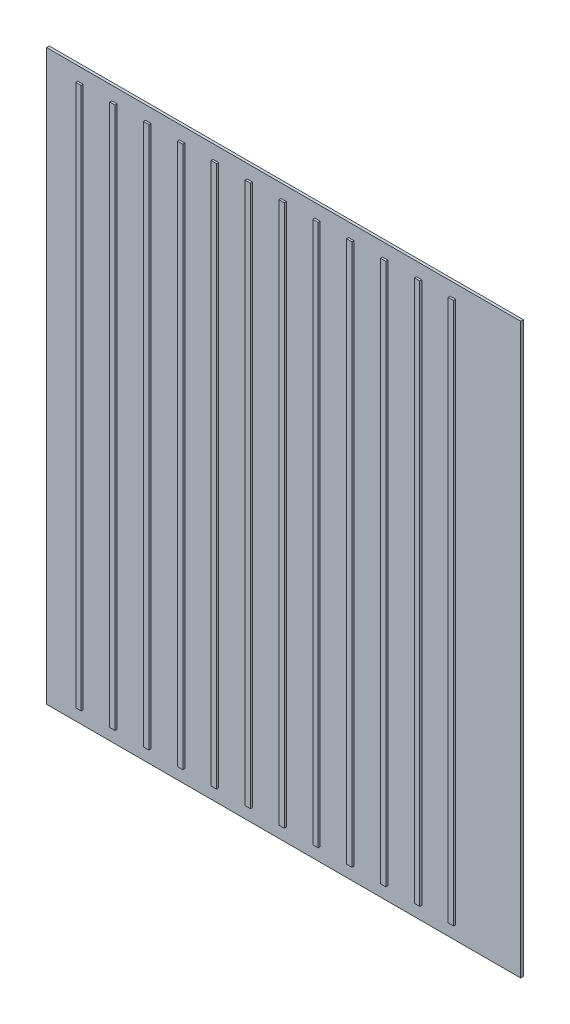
ISO-10303-21;
HEADER;
FILE_DESCRIPTION(('STEP AP214'),'2;1');
FILE_NAME('part.step','',(''),(''),'','','');
FILE_SCHEMA(('AUTOMOTIVE_DESIGN { 1 0 10303 214 1 1 1 1 }'));
ENDSEC;
DATA;
#1=APPLICATION_CONTEXT('core data for automotive mechanical design processes');
#2=APPLICATION_PROTOCOL_DEFINITION('international standard','automotive_design',2000,#1);
#3=PRODUCT_CONTEXT('',#1,'mechanical');
#4=PRODUCT('Part','Part','',(#3));
#5=PRODUCT_RELATED_PRODUCT_CATEGORY('part','',(#4));
#6=PRODUCT_DEFINITION_FORMATION('','',#4);
#7=PRODUCT_DEFINITION_CONTEXT('part definition',#1,'design');
#8=PRODUCT_DEFINITION('design','',#6,#7);
#9=PRODUCT_DEFINITION_SHAPE('','',#8);
#10=(LENGTH_UNIT() NAMED_UNIT(*) SI_UNIT(.MILLI.,.METRE.));
#11=(NAMED_UNIT(*) PLANE_ANGLE_UNIT() SI_UNIT($,.RADIAN.));
#12=(NAMED_UNIT(*) SI_UNIT($,.STERADIAN.) SOLID_ANGLE_UNIT());
#13=UNCERTAINTY_MEASURE_WITH_UNIT(LENGTH_MEASURE(1.E-05),#10,'distance_accuracy_value','');
#14=(GEOMETRIC_REPRESENTATION_CONTEXT(3) GLOBAL_UNCERTAINTY_ASSIGNED_CONTEXT((#13)) GLOBAL_UNIT_ASSIGNED_CONTEXT((#10,
#11,#12)) REPRESENTATION_CONTEXT('',''));
#15=CARTESIAN_POINT('',(0.,0.,0.));
#16=DIRECTION('',(0.,0.,1.));
#17=DIRECTION('',(1.,0.,0.));
#18=AXIS2_PLACEMENT_3D('',#15,#16,#17);
#19=CARTESIAN_POINT('',(0.,0.,20.));
#20=DIRECTION('',(0.,0.,-1.));
#21=DIRECTION('',(-1.,0.,0.));
#22=AXIS2_PLACEMENT_3D('',#19,#20,#21);
#23=PLANE('',#22);
#24=DIRECTION('',(0.,-1.,0.));
#25=VECTOR('',#24,1.);
#26=CARTESIAN_POINT('',(480.,0.,20.));
#27=LINE('',#26,#25);
#28=CARTESIAN_POINT('',(480.,4100.,20.));
#29=VERTEX_POINT('',#28);
#30=CARTESIAN_POINT('',(480.,100.,20.));
#31=VERTEX_POINT('',#30);
#32=EDGE_CURVE('E751',#29,#31,#27,.T.);
#33=ORIENTED_EDGE('',*,*,#32,.F.);
#34=DIRECTION('',(-1.,0.,0.));
#35=VECTOR('',#34,1.);
#36=CARTESIAN_POINT('',(0.,4100.,20.));
#37=LINE('',#36,#35);
#38=CARTESIAN_POINT('',(520.,4100.,20.));
#39=VERTEX_POINT('',#38);
#40=EDGE_CURVE('E743',#39,#29,#37,.T.);
#41=ORIENTED_EDGE('',*,*,#40,.F.);
#42=DIRECTION('',(0.,1.,0.));
#43=VECTOR('',#42,1.);
#44=CARTESIAN_POINT('',(520.,0.,20.));
#45=LINE('',#44,#43);
#46=CARTESIAN_POINT('',(520.,100.,20.));
#47=VERTEX_POINT('',#46);
#48=EDGE_CURVE('E747',#47,#39,#45,.T.);
#49=ORIENTED_EDGE('',*,*,#48,.F.);
#50=DIRECTION('',(1.,0.,0.));
#51=VECTOR('',#50,1.);
#52=CARTESIAN_POINT('',(0.,100.,20.));
#53=LINE('',#52,#51);
#54=EDGE_CURVE('E749',#31,#47,#53,.T.);
#55=ORIENTED_EDGE('',*,*,#54,.F.);
#56=EDGE_LOOP('',(#33,#41,#49,#55));
#57=FACE_BOUND('',#56,.T.);
#58=DIRECTION('',(0.,-1.,0.));
#59=VECTOR('',#58,1.);
#60=CARTESIAN_POINT('',(980.,0.,20.));
#61=LINE('',#60,#59);
#62=CARTESIAN_POINT('',(980.,4100.,20.));
#63=VERTEX_POINT('',#62);
#64=CARTESIAN_POINT('',(980.,100.,20.));
#65=VERTEX_POINT('',#64);
#66=EDGE_CURVE('E728',#63,#65,#61,.T.);
#67=ORIENTED_EDGE('',*,*,#66,.F.);
#68=DIRECTION('',(-1.,0.,0.));
#69=VECTOR('',#68,1.);
#70=CARTESIAN_POINT('',(0.,4100.,20.));
#71=LINE('',#70,#69);
#72=CARTESIAN_POINT('',(1020.,4100.,20.));
#73=VERTEX_POINT('',#72);
#74=EDGE_CURVE('E718',#73,#63,#71,.T.);
#75=ORIENTED_EDGE('',*,*,#74,.F.);
#76=DIRECTION('',(0.,1.,0.));
#77=VECTOR('',#76,1.);
#78=CARTESIAN_POINT('',(1020.,0.,20.));
#79=LINE('',#78,#77);
#80=CARTESIAN_POINT('',(1020.,100.,20.));
#81=VERTEX_POINT('',#80);
#82=EDGE_CURVE('E722',#81,#73,#79,.T.);
#83=ORIENTED_EDGE('',*,*,#82,.F.);
#84=DIRECTION('',(1.,0.,0.));
#85=VECTOR('',#84,1.);
#86=CARTESIAN_POINT('',(0.,100.,20.));
#87=LINE('',#86,#85);
#88=EDGE_CURVE('E726',#65,#81,#87,.T.);
#89=ORIENTED_EDGE('',*,*,#88,.F.);
#90=EDGE_LOOP('',(#67,#75,#83,#89));
#91=FACE_BOUND('',#90,.T.);
#92=DIRECTION('',(0.,-1.,0.));
#93=VECTOR('',#92,1.);
#94=CARTESIAN_POINT('',(1480.,0.,20.));
#95=LINE('',#94,#93);
#96=CARTESIAN_POINT('',(1480.,4100.,20.));
#97=VERTEX_POINT('',#96);
#98=CARTESIAN_POINT('',(1480.,100.,20.));
#99=VERTEX_POINT('',#98);
#100=EDGE_CURVE('E704',#97,#99,#95,.T.);
#101=ORIENTED_EDGE('',*,*,#100,.F.);
#102=DIRECTION('',(-1.,0.,0.));
#103=VECTOR('',#102,1.);
#104=CARTESIAN_POINT('',(0.,4100.,20.));
#105=LINE('',#104,#103);
#106=CARTESIAN_POINT('',(1520.,4100.,20.));
#107=VERTEX_POINT('',#106);
#108=EDGE_CURVE('E698',#107,#97,#105,.T.);
#109=ORIENTED_EDGE('',*,*,#108,.F.);
#110=DIRECTION('',(0.,1.,0.));
#111=VECTOR('',#110,1.);
#112=CARTESIAN_POINT('',(1520.,0.,20.));
#113=LINE('',#112,#111);
#114=CARTESIAN_POINT('',(1520.,100.,20.));
#115=VERTEX_POINT('',#114);
#116=EDGE_CURVE('E699',#115,#107,#113,.T.);
#117=ORIENTED_EDGE('',*,*,#116,.F.);
#118=DIRECTION('',(1.,0.,0.));
#119=VECTOR('',#118,1.);
#120=CARTESIAN_POINT('',(0.,100.,20.));
#121=LINE('',#120,#119);
#122=EDGE_CURVE('E705',#99,#115,#121,.T.);
#123=ORIENTED_EDGE('',*,*,#122,.F.);
#124=EDGE_LOOP('',(#101,#109,#117,#123));
#125=FACE_BOUND('',#124,.T.);
#126=DIRECTION('',(0.,-1.,0.));
#127=VECTOR('',#126,1.);
#128=CARTESIAN_POINT('',(1980.,0.,20.));
#129=LINE('',#128,#127);
#130=CARTESIAN_POINT('',(1980.,4100.,20.));
#131=VERTEX_POINT('',#130);
#132=CARTESIAN_POINT('',(1980.,100.,20.));
#133=VERTEX_POINT('',#132);
#134=EDGE_CURVE('E681',#131,#133,#129,.T.);
#135=ORIENTED_EDGE('',*,*,#134,.F.);
#136=DIRECTION('',(-1.,0.,0.));
#137=VECTOR('',#136,1.);
#138=CARTESIAN_POINT('',(0.,4100.,20.));
#139=LINE('',#138,#137);
#140=CARTESIAN_POINT('',(2020.,4100.,20.));
#141=VERTEX_POINT('',#140);
#142=EDGE_CURVE('E675',#141,#131,#139,.T.);
#143=ORIENTED_EDGE('',*,*,#142,.F.);
#144=DIRECTION('',(0.,1.,0.));
#145=VECTOR('',#144,1.);
#146=CARTESIAN_POINT('',(2020.,0.,20.));
#147=LINE('',#146,#145);
#148=CARTESIAN_POINT('',(2020.,100.,20.));
#149=VERTEX_POINT('',#148);
#150=EDGE_CURVE('E674',#149,#141,#147,.T.);
#151=ORIENTED_EDGE('',*,*,#150,.F.);
#152=DIRECTION('',(1.,0.,0.));
#153=VECTOR('',#152,1.);
#154=CARTESIAN_POINT('',(0.,100.,20.));
#155=LINE('',#154,#153);
#156=EDGE_CURVE('E676',#133,#149,#155,.T.);
#157=ORIENTED_EDGE('',*,*,#156,.F.);
#158=EDGE_LOOP('',(#135,#143,#151,#157));
#159=FACE_BOUND('',#158,.T.);
#160=DIRECTION('',(0.,-1.,0.));
#161=VECTOR('',#160,1.);
#162=CARTESIAN_POINT('',(2480.,0.,20.));
#163=LINE('',#162,#161);
#164=CARTESIAN_POINT('',(2480.,4100.,20.));
#165=VERTEX_POINT('',#164);
#166=CARTESIAN_POINT('',(2480.,100.,20.));
#167=VERTEX_POINT('',#166);
#168=EDGE_CURVE('E660',#165,#167,#163,.T.);
#169=ORIENTED_EDGE('',*,*,#168,.F.);
#170=DIRECTION('',(-1.,0.,0.));
#171=VECTOR('',#170,1.);
#172=CARTESIAN_POINT('',(0.,4100.,20.));
#173=LINE('',#172,#171);
#174=CARTESIAN_POINT('',(2520.,4100.,20.));
#175=VERTEX_POINT('',#174);
#176=EDGE_CURVE('E648',#175,#165,#173,.T.);
#177=ORIENTED_EDGE('',*,*,#176,.F.);
#178=DIRECTION('',(0.,1.,0.));
#179=VECTOR('',#178,1.);
#180=CARTESIAN_POINT('',(2520.,0.,20.));
#181=LINE('',#180,#179);
#182=CARTESIAN_POINT('',(2520.,100.,20.));
#183=VERTEX_POINT('',#182);
#184=EDGE_CURVE('E651',#183,#175,#181,.T.);
#185=ORIENTED_EDGE('',*,*,#184,.F.);
#186=DIRECTION('',(1.,0.,0.));
#187=VECTOR('',#186,1.);
#188=CARTESIAN_POINT('',(0.,100.,20.));
#189=LINE('',#188,#187);
#190=EDGE_CURVE('E652',#167,#183,#189,.T.);
#191=ORIENTED_EDGE('',*,*,#190,.F.);
#192=EDGE_LOOP('',(#169,#177,#185,#191));
#193=FACE_BOUND('',#192,.T.);
#194=DIRECTION('',(0.,-1.,0.));
#195=VECTOR('',#194,1.);
#196=CARTESIAN_POINT('',(2980.,0.,20.));
#197=LINE('',#196,#195);
#198=CARTESIAN_POINT('',(2980.,4100.,20.));
#199=VERTEX_POINT('',#198);
#200=CARTESIAN_POINT('',(2980.,100.,20.));
#201=VERTEX_POINT('',#200);
#202=EDGE_CURVE('E632',#199,#201,#197,.T.);
#203=ORIENTED_EDGE('',*,*,#202,.F.);
#204=DIRECTION('',(-1.,0.,0.));
#205=VECTOR('',#204,1.);
#206=CARTESIAN_POINT('',(0.,4100.,20.));
#207=LINE('',#206,#205);
#208=CARTESIAN_POINT('',(3020.,4100.,20.));
#209=VERTEX_POINT('',#208);
#210=EDGE_CURVE('E386',#209,#199,#207,.T.);
#211=ORIENTED_EDGE('',*,*,#210,.F.);
#212=DIRECTION('',(0.,1.,0.));
#213=VECTOR('',#212,1.);
#214=CARTESIAN_POINT('',(3020.,0.,20.));
#215=LINE('',#214,#213);
#216=CARTESIAN_POINT('',(3020.,100.,20.));
#217=VERTEX_POINT('',#216);
#218=EDGE_CURVE('E395',#217,#209,#215,.T.);
#219=ORIENTED_EDGE('',*,*,#218,.F.);
#220=DIRECTION('',(1.,0.,0.));
#221=VECTOR('',#220,1.);
#222=CARTESIAN_POINT('',(0.,100.,20.));
#223=LINE('',#222,#221);
#224=EDGE_CURVE('E629',#201,#217,#223,.T.);
#225=ORIENTED_EDGE('',*,*,#224,.F.);
#226=EDGE_LOOP('',(#203,#211,#219,#225));
#227=FACE_BOUND('',#226,.T.);
#228=DIRECTION('',(0.,-1.,0.));
#229=VECTOR('',#228,1.);
#230=CARTESIAN_POINT('',(0.,0.,20.));
#231=LINE('',#230,#229);
#232=CARTESIAN_POINT('',(0.,4200.,20.));
#233=VERTEX_POINT('',#232);
#234=CARTESIAN_POINT('',(0.,0.,20.));
#235=VERTEX_POINT('',#234);
#236=EDGE_CURVE('E763',#233,#235,#231,.T.);
#237=ORIENTED_EDGE('',*,*,#236,.T.);
#238=DIRECTION('',(1.,0.,0.));
#239=VECTOR('',#238,1.);
#240=CARTESIAN_POINT('',(0.,0.,20.));
#241=LINE('',#240,#239);
#242=CARTESIAN_POINT('',(3500.,0.,20.));
#243=VERTEX_POINT('',#242);
#244=EDGE_CURVE('E766',#235,#243,#241,.T.);
#245=ORIENTED_EDGE('',*,*,#244,.T.);
#246=DIRECTION('',(0.,1.,0.));
#247=VECTOR('',#246,1.);
#248=CARTESIAN_POINT('',(3500.,0.,20.));
#249=LINE('',#248,#247);
#250=CARTESIAN_POINT('',(3500.,4200.,20.));
#251=VERTEX_POINT('',#250);
#252=EDGE_CURVE('E768',#243,#251,#249,.T.);
#253=ORIENTED_EDGE('',*,*,#252,.T.);
#254=DIRECTION('',(-1.,0.,0.));
#255=VECTOR('',#254,1.);
#256=CARTESIAN_POINT('',(0.,4200.,20.));
#257=LINE('',#256,#255);
#258=EDGE_CURVE('E772',#251,#233,#257,.T.);
#259=ORIENTED_EDGE('',*,*,#258,.T.);
#260=EDGE_LOOP('',(#237,#245,#253,#259));
#261=FACE_BOUND('',#260,.T.);
#262=DIRECTION('',(0.,-1.,0.));
#263=VECTOR('',#262,1.);
#264=CARTESIAN_POINT('',(2730.,0.,20.));
#265=LINE('',#264,#263);
#266=CARTESIAN_POINT('',(2730.,4100.,20.));
#267=VERTEX_POINT('',#266);
#268=CARTESIAN_POINT('',(2730.,100.,20.));
#269=VERTEX_POINT('',#268);
#270=EDGE_CURVE('E642',#267,#269,#265,.T.);
#271=ORIENTED_EDGE('',*,*,#270,.F.);
#272=DIRECTION('',(-1.,0.,0.));
#273=VECTOR('',#272,1.);
#274=CARTESIAN_POINT('',(0.,4100.,20.));
#275=LINE('',#274,#273);
#276=CARTESIAN_POINT('',(2770.,4100.,20.));
#277=VERTEX_POINT('',#276);
#278=EDGE_CURVE('E638',#277,#267,#275,.T.);
#279=ORIENTED_EDGE('',*,*,#278,.F.);
#280=DIRECTION('',(0.,1.,0.));
#281=VECTOR('',#280,1.);
#282=CARTESIAN_POINT('',(2770.,0.,20.));
#283=LINE('',#282,#281);
#284=CARTESIAN_POINT('',(2770.,100.,20.));
#285=VERTEX_POINT('',#284);
#286=EDGE_CURVE('E640',#285,#277,#283,.T.);
#287=ORIENTED_EDGE('',*,*,#286,.F.);
#288=DIRECTION('',(1.,0.,0.));
#289=VECTOR('',#288,1.);
#290=CARTESIAN_POINT('',(0.,100.,20.));
#291=LINE('',#290,#289);
#292=EDGE_CURVE('E645',#269,#285,#291,.T.);
#293=ORIENTED_EDGE('',*,*,#292,.F.);
#294=EDGE_LOOP('',(#271,#279,#287,#293));
#295=FACE_BOUND('',#294,.T.);
#296=DIRECTION('',(0.,-1.,0.));
#297=VECTOR('',#296,1.);
#298=CARTESIAN_POINT('',(2230.,0.,20.));
#299=LINE('',#298,#297);
#300=CARTESIAN_POINT('',(2230.,4100.,20.));
#301=VERTEX_POINT('',#300);
#302=CARTESIAN_POINT('',(2230.,100.,20.));
#303=VERTEX_POINT('',#302);
#304=EDGE_CURVE('E668',#301,#303,#299,.T.);
#305=ORIENTED_EDGE('',*,*,#304,.F.);
#306=DIRECTION('',(-1.,0.,0.));
#307=VECTOR('',#306,1.);
#308=CARTESIAN_POINT('',(0.,4100.,20.));
#309=LINE('',#308,#307);
#310=CARTESIAN_POINT('',(2270.,4100.,20.));
#311=VERTEX_POINT('',#310);
#312=EDGE_CURVE('E659',#311,#301,#309,.T.);
#313=ORIENTED_EDGE('',*,*,#312,.F.);
#314=DIRECTION('',(0.,1.,0.));
#315=VECTOR('',#314,1.);
#316=CARTESIAN_POINT('',(2270.,0.,20.));
#317=LINE('',#316,#315);
#318=CARTESIAN_POINT('',(2270.,100.,20.));
#319=VERTEX_POINT('',#318);
#320=EDGE_CURVE('E664',#319,#311,#317,.T.);
#321=ORIENTED_EDGE('',*,*,#320,.F.);
#322=DIRECTION('',(1.,0.,0.));
#323=VECTOR('',#322,1.);
#324=CARTESIAN_POINT('',(0.,100.,20.));
#325=LINE('',#324,#323);
#326=EDGE_CURVE('E666',#303,#319,#325,.T.);
#327=ORIENTED_EDGE('',*,*,#326,.F.);
#328=EDGE_LOOP('',(#305,#313,#321,#327));
#329=FACE_BOUND('',#328,.T.);
#330=DIRECTION('',(0.,-1.,0.));
#331=VECTOR('',#330,1.);
#332=CARTESIAN_POINT('',(1730.,0.,20.));
#333=LINE('',#332,#331);
#334=CARTESIAN_POINT('',(1730.,4100.,20.));
#335=VERTEX_POINT('',#334);
#336=CARTESIAN_POINT('',(1730.,100.,20.));
#337=VERTEX_POINT('',#336);
#338=EDGE_CURVE('E691',#335,#337,#333,.T.);
#339=ORIENTED_EDGE('',*,*,#338,.F.);
#340=DIRECTION('',(-1.,0.,0.));
#341=VECTOR('',#340,1.);
#342=CARTESIAN_POINT('',(0.,4100.,20.));
#343=LINE('',#342,#341);
#344=CARTESIAN_POINT('',(1770.,4100.,20.));
#345=VERTEX_POINT('',#344);
#346=EDGE_CURVE('E683',#345,#335,#343,.T.);
#347=ORIENTED_EDGE('',*,*,#346,.F.);
#348=DIRECTION('',(0.,1.,0.));
#349=VECTOR('',#348,1.);
#350=CARTESIAN_POINT('',(1770.,0.,20.));
#351=LINE('',#350,#349);
#352=CARTESIAN_POINT('',(1770.,100.,20.));
#353=VERTEX_POINT('',#352);
#354=EDGE_CURVE('E690',#353,#345,#351,.T.);
#355=ORIENTED_EDGE('',*,*,#354,.F.);
#356=DIRECTION('',(1.,0.,0.));
#357=VECTOR('',#356,1.);
#358=CARTESIAN_POINT('',(0.,100.,20.));
#359=LINE('',#358,#357);
#360=EDGE_CURVE('E689',#337,#353,#359,.T.);
#361=ORIENTED_EDGE('',*,*,#360,.F.);
#362=EDGE_LOOP('',(#339,#347,#355,#361));
#363=FACE_BOUND('',#362,.T.);
#364=DIRECTION('',(0.,-1.,0.));
#365=VECTOR('',#364,1.);
#366=CARTESIAN_POINT('',(1230.,0.,20.));
#367=LINE('',#366,#365);
#368=CARTESIAN_POINT('',(1230.,4100.,20.));
#369=VERTEX_POINT('',#368);
#370=CARTESIAN_POINT('',(1230.,100.,20.));
#371=VERTEX_POINT('',#370);
#372=EDGE_CURVE('E720',#369,#371,#367,.T.);
#373=ORIENTED_EDGE('',*,*,#372,.F.);
#374=DIRECTION('',(-1.,0.,0.));
#375=VECTOR('',#374,1.);
#376=CARTESIAN_POINT('',(0.,4100.,20.));
#377=LINE('',#376,#375);
#378=CARTESIAN_POINT('',(1270.,4100.,20.));
#379=VERTEX_POINT('',#378);
#380=EDGE_CURVE('E708',#379,#369,#377,.T.);
#381=ORIENTED_EDGE('',*,*,#380,.F.);
#382=DIRECTION('',(0.,1.,0.));
#383=VECTOR('',#382,1.);
#384=CARTESIAN_POINT('',(1270.,0.,20.));
#385=LINE('',#384,#383);
#386=CARTESIAN_POINT('',(1270.,100.,20.));
#387=VERTEX_POINT('',#386);
#388=EDGE_CURVE('E711',#387,#379,#385,.T.);
#389=ORIENTED_EDGE('',*,*,#388,.F.);
#390=DIRECTION('',(1.,0.,0.));
#391=VECTOR('',#390,1.);
#392=CARTESIAN_POINT('',(0.,100.,20.));
#393=LINE('',#392,#391);
#394=EDGE_CURVE('E713',#371,#387,#393,.T.);
#395=ORIENTED_EDGE('',*,*,#394,.F.);
#396=EDGE_LOOP('',(#373,#381,#389,#395));
#397=FACE_BOUND('',#396,.T.);
#398=DIRECTION('',(0.,-1.,0.));
#399=VECTOR('',#398,1.);
#400=CARTESIAN_POINT('',(730.,0.,20.));
#401=LINE('',#400,#399);
#402=CARTESIAN_POINT('',(730.,4100.,20.));
#403=VERTEX_POINT('',#402);
#404=CARTESIAN_POINT('',(730.,100.,20.));
#405=VERTEX_POINT('',#404);
#406=EDGE_CURVE('E741',#403,#405,#401,.T.);
#407=ORIENTED_EDGE('',*,*,#406,.F.);
#408=DIRECTION('',(-1.,0.,0.));
#409=VECTOR('',#408,1.);
#410=CARTESIAN_POINT('',(0.,4100.,20.));
#411=LINE('',#410,#409);
#412=CARTESIAN_POINT('',(770.,4100.,20.));
#413=VERTEX_POINT('',#412);
#414=EDGE_CURVE('E735',#413,#403,#411,.T.);
#415=ORIENTED_EDGE('',*,*,#414,.F.);
#416=DIRECTION('',(0.,1.,0.));
#417=VECTOR('',#416,1.);
#418=CARTESIAN_POINT('',(770.,0.,20.));
#419=LINE('',#418,#417);
#420=CARTESIAN_POINT('',(770.,100.,20.));
#421=VERTEX_POINT('',#420);
#422=EDGE_CURVE('E733',#421,#413,#419,.T.);
#423=ORIENTED_EDGE('',*,*,#422,.F.);
#424=DIRECTION('',(1.,0.,0.));
#425=VECTOR('',#424,1.);
#426=CARTESIAN_POINT('',(0.,100.,20.));
#427=LINE('',#426,#425);
#428=EDGE_CURVE('E737',#405,#421,#427,.T.);
#429=ORIENTED_EDGE('',*,*,#428,.F.);
#430=EDGE_LOOP('',(#407,#415,#423,#429));
#431=FACE_BOUND('',#430,.T.);
#432=DIRECTION('',(0.,-1.,0.));
#433=VECTOR('',#432,1.);
#434=CARTESIAN_POINT('',(230.,0.,20.));
#435=LINE('',#434,#433);
#436=CARTESIAN_POINT('',(230.,4100.,20.));
#437=VERTEX_POINT('',#436);
#438=CARTESIAN_POINT('',(230.,100.,20.));
#439=VERTEX_POINT('',#438);
#440=EDGE_CURVE('E389',#437,#439,#435,.T.);
#441=ORIENTED_EDGE('',*,*,#440,.F.);
#442=DIRECTION('',(-1.,0.,0.));
#443=VECTOR('',#442,1.);
#444=CARTESIAN_POINT('',(0.,4100.,20.));
#445=LINE('',#444,#443);
#446=CARTESIAN_POINT('',(270.,4100.,20.));
#447=VERTEX_POINT('',#446);
#448=EDGE_CURVE('E756',#447,#437,#445,.T.);
#449=ORIENTED_EDGE('',*,*,#448,.F.);
#450=DIRECTION('',(0.,1.,0.));
#451=VECTOR('',#450,1.);
#452=CARTESIAN_POINT('',(270.,0.,20.));
#453=LINE('',#452,#451);
#454=CARTESIAN_POINT('',(270.,100.,20.));
#455=VERTEX_POINT('',#454);
#456=EDGE_CURVE('E56',#455,#447,#453,.T.);
#457=ORIENTED_EDGE('',*,*,#456,.F.);
#458=DIRECTION('',(1.,0.,0.));
#459=VECTOR('',#458,1.);
#460=CARTESIAN_POINT('',(0.,100.,20.));
#461=LINE('',#460,#459);
#462=EDGE_CURVE('E53',#439,#455,#461,.T.);
#463=ORIENTED_EDGE('',*,*,#462,.F.);
#464=EDGE_LOOP('',(#441,#449,#457,#463));
#465=FACE_BOUND('',#464,.T.);
#466=ADVANCED_FACE('F39',(#57,#91,#125,#159,#193,#227,#261,#295,#329,#363,#397,#431,#465),#23,.F.);
#467=CARTESIAN_POINT('',(0.,0.,20.));
#468=DIRECTION('',(1.,0.,0.));
#469=DIRECTION('',(0.,0.,-1.));
#470=AXIS2_PLACEMENT_3D('',#467,#468,#469);
#471=PLANE('',#470);
#472=DIRECTION('',(0.,-1.,0.));
#473=VECTOR('',#472,1.);
#474=CARTESIAN_POINT('',(0.,0.,0.));
#475=LINE('',#474,#473);
#476=CARTESIAN_POINT('',(0.,4200.,0.));
#477=VERTEX_POINT('',#476);
#478=CARTESIAN_POINT('',(0.,0.,0.));
#479=VERTEX_POINT('',#478);
#480=EDGE_CURVE('E765',#477,#479,#475,.T.);
#481=ORIENTED_EDGE('',*,*,#480,.T.);
#482=DIRECTION('',(0.,0.,-1.));
#483=VECTOR('',#482,1.);
#484=CARTESIAN_POINT('',(0.,0.,20.));
#485=LINE('',#484,#483);
#486=EDGE_CURVE('E11',#235,#479,#485,.T.);
#487=ORIENTED_EDGE('',*,*,#486,.F.);
#488=ORIENTED_EDGE('',*,*,#236,.F.);
#489=DIRECTION('',(0.,0.,-1.));
#490=VECTOR('',#489,1.);
#491=CARTESIAN_POINT('',(0.,4200.,20.));
#492=LINE('',#491,#490);
#493=EDGE_CURVE('E774',#233,#477,#492,.T.);
#494=ORIENTED_EDGE('',*,*,#493,.T.);
#495=EDGE_LOOP('',(#481,#487,#488,#494));
#496=FACE_BOUND('',#495,.T.);
#497=ADVANCED_FACE('F41',(#496),#471,.F.);
#498=CARTESIAN_POINT('',(0.,0.,20.));
#499=DIRECTION('',(0.,1.,0.));
#500=DIRECTION('',(0.,0.,1.));
#501=AXIS2_PLACEMENT_3D('',#498,#499,#500);
#502=PLANE('',#501);
#503=DIRECTION('',(1.,0.,0.));
#504=VECTOR('',#503,1.);
#505=CARTESIAN_POINT('',(0.,0.,0.));
#506=LINE('',#505,#504);
#507=CARTESIAN_POINT('',(3500.,0.,0.));
#508=VERTEX_POINT('',#507);
#509=EDGE_CURVE('E776',#479,#508,#506,.T.);
#510=ORIENTED_EDGE('',*,*,#509,.T.);
#511=DIRECTION('',(0.,0.,-1.));
#512=VECTOR('',#511,1.);
#513=CARTESIAN_POINT('',(3500.,0.,20.));
#514=LINE('',#513,#512);
#515=EDGE_CURVE('E50',#243,#508,#514,.T.);
#516=ORIENTED_EDGE('',*,*,#515,.F.);
#517=ORIENTED_EDGE('',*,*,#244,.F.);
#518=ORIENTED_EDGE('',*,*,#486,.T.);
#519=EDGE_LOOP('',(#510,#516,#517,#518));
#520=FACE_BOUND('',#519,.T.);
#521=ADVANCED_FACE('F808',(#520),#502,.F.);
#522=CARTESIAN_POINT('',(3500.,0.,20.));
#523=DIRECTION('',(-1.,0.,0.));
#524=DIRECTION('',(0.,0.,1.));
#525=AXIS2_PLACEMENT_3D('',#522,#523,#524);
#526=PLANE('',#525);
#527=DIRECTION('',(0.,1.,0.));
#528=VECTOR('',#527,1.);
#529=CARTESIAN_POINT('',(3500.,0.,0.));
#530=LINE('',#529,#528);
#531=CARTESIAN_POINT('',(3500.,4200.,0.));
#532=VERTEX_POINT('',#531);
#533=EDGE_CURVE('E777',#508,#532,#530,.T.);
#534=ORIENTED_EDGE('',*,*,#533,.T.);
#535=DIRECTION('',(0.,0.,-1.));
#536=VECTOR('',#535,1.);
#537=CARTESIAN_POINT('',(3500.,4200.,20.));
#538=LINE('',#537,#536);
#539=EDGE_CURVE('E782',#251,#532,#538,.T.);
#540=ORIENTED_EDGE('',*,*,#539,.F.);
#541=ORIENTED_EDGE('',*,*,#252,.F.);
#542=ORIENTED_EDGE('',*,*,#515,.T.);
#543=EDGE_LOOP('',(#534,#540,#541,#542));
#544=FACE_BOUND('',#543,.T.);
#545=ADVANCED_FACE('F788',(#544),#526,.F.);
#546=CARTESIAN_POINT('',(0.,4200.,20.));
#547=DIRECTION('',(0.,-1.,0.));
#548=DIRECTION('',(0.,0.,-1.));
#549=AXIS2_PLACEMENT_3D('',#546,#547,#548);
#550=PLANE('',#549);
#551=DIRECTION('',(-1.,0.,0.));
#552=VECTOR('',#551,1.);
#553=CARTESIAN_POINT('',(0.,4200.,0.));
#554=LINE('',#553,#552);
#555=EDGE_CURVE('E770',#532,#477,#554,.T.);
#556=ORIENTED_EDGE('',*,*,#555,.T.);
#557=ORIENTED_EDGE('',*,*,#493,.F.);
#558=ORIENTED_EDGE('',*,*,#258,.F.);
#559=ORIENTED_EDGE('',*,*,#539,.T.);
#560=EDGE_LOOP('',(#556,#557,#558,#559));
#561=FACE_BOUND('',#560,.T.);
#562=ADVANCED_FACE('F798',(#561),#550,.F.);
#563=CARTESIAN_POINT('',(0.,0.,0.));
#564=DIRECTION('',(0.,0.,-1.));
#565=DIRECTION('',(-1.,0.,0.));
#566=AXIS2_PLACEMENT_3D('',#563,#564,#565);
#567=PLANE('',#566);
#568=ORIENTED_EDGE('',*,*,#480,.F.);
#569=ORIENTED_EDGE('',*,*,#555,.F.);
#570=ORIENTED_EDGE('',*,*,#533,.F.);
#571=ORIENTED_EDGE('',*,*,#509,.F.);
#572=EDGE_LOOP('',(#568,#569,#570,#571));
#573=FACE_BOUND('',#572,.T.);
#574=ADVANCED_FACE('F796',(#573),#567,.T.);
#575=CARTESIAN_POINT('',(2980.,100.,35.));
#576=DIRECTION('',(1.,0.,0.));
#577=DIRECTION('',(0.,0.,-1.));
#578=AXIS2_PLACEMENT_3D('',#575,#576,#577);
#579=PLANE('',#578);
#580=DIRECTION('',(0.,0.,-1.));
#581=VECTOR('',#580,1.);
#582=CARTESIAN_POINT('',(2980.,4100.,35.));
#583=LINE('',#582,#581);
#584=CARTESIAN_POINT('',(2980.,4100.,35.));
#585=VERTEX_POINT('',#584);
#586=EDGE_CURVE('E620',#585,#199,#583,.T.);
#587=ORIENTED_EDGE('',*,*,#586,.T.);
#588=ORIENTED_EDGE('',*,*,#202,.T.);
#589=DIRECTION('',(0.,0.,-1.));
#590=VECTOR('',#589,1.);
#591=CARTESIAN_POINT('',(2980.,100.,35.));
#592=LINE('',#591,#590);
#593=CARTESIAN_POINT('',(2980.,100.,35.));
#594=VERTEX_POINT('',#593);
#595=EDGE_CURVE('E609',#594,#201,#592,.T.);
#596=ORIENTED_EDGE('',*,*,#595,.F.);
#597=DIRECTION('',(0.,-1.,0.));
#598=VECTOR('',#597,1.);
#599=CARTESIAN_POINT('',(2980.,100.,35.));
#600=LINE('',#599,#598);
#601=EDGE_CURVE('E591',#585,#594,#600,.T.);
#602=ORIENTED_EDGE('',*,*,#601,.F.);
#603=EDGE_LOOP('',(#587,#588,#596,#602));
#604=FACE_BOUND('',#603,.T.);
#605=ADVANCED_FACE('F827',(#604),#579,.F.);
#606=CARTESIAN_POINT('',(2980.,100.,35.));
#607=DIRECTION('',(0.,1.,0.));
#608=DIRECTION('',(0.,0.,1.));
#609=AXIS2_PLACEMENT_3D('',#606,#607,#608);
#610=PLANE('',#609);
#611=ORIENTED_EDGE('',*,*,#595,.T.);
#612=ORIENTED_EDGE('',*,*,#224,.T.);
#613=DIRECTION('',(0.,0.,-1.));
#614=VECTOR('',#613,1.);
#615=CARTESIAN_POINT('',(3020.,100.,35.));
#616=LINE('',#615,#614);
#617=CARTESIAN_POINT('',(3020.,100.,35.));
#618=VERTEX_POINT('',#617);
#619=EDGE_CURVE('E611',#618,#217,#616,.T.);
#620=ORIENTED_EDGE('',*,*,#619,.F.);
#621=DIRECTION('',(1.,0.,0.));
#622=VECTOR('',#621,1.);
#623=CARTESIAN_POINT('',(2980.,100.,35.));
#624=LINE('',#623,#622);
#625=EDGE_CURVE('E624',#594,#618,#624,.T.);
#626=ORIENTED_EDGE('',*,*,#625,.F.);
#627=EDGE_LOOP('',(#611,#612,#620,#626));
#628=FACE_BOUND('',#627,.T.);
#629=ADVANCED_FACE('F861',(#628),#610,.F.);
#630=CARTESIAN_POINT('',(3020.,100.,35.));
#631=DIRECTION('',(-1.,0.,0.));
#632=DIRECTION('',(0.,0.,1.));
#633=AXIS2_PLACEMENT_3D('',#630,#631,#632);
#634=PLANE('',#633);
#635=ORIENTED_EDGE('',*,*,#619,.T.);
#636=ORIENTED_EDGE('',*,*,#218,.T.);
#637=DIRECTION('',(0.,0.,-1.));
#638=VECTOR('',#637,1.);
#639=CARTESIAN_POINT('',(3020.,4100.,35.));
#640=LINE('',#639,#638);
#641=CARTESIAN_POINT('',(3020.,4100.,35.));
#642=VERTEX_POINT('',#641);
#643=EDGE_CURVE('E613',#642,#209,#640,.T.);
#644=ORIENTED_EDGE('',*,*,#643,.F.);
#645=DIRECTION('',(0.,1.,0.));
#646=VECTOR('',#645,1.);
#647=CARTESIAN_POINT('',(3020.,100.,35.));
#648=LINE('',#647,#646);
#649=EDGE_CURVE('E625',#618,#642,#648,.T.);
#650=ORIENTED_EDGE('',*,*,#649,.F.);
#651=EDGE_LOOP('',(#635,#636,#644,#650));
#652=FACE_BOUND('',#651,.T.);
#653=ADVANCED_FACE('F875',(#652),#634,.F.);
#654=CARTESIAN_POINT('',(2980.,4100.,35.));
#655=DIRECTION('',(0.,-1.,0.));
#656=DIRECTION('',(0.,0.,-1.));
#657=AXIS2_PLACEMENT_3D('',#654,#655,#656);
#658=PLANE('',#657);
#659=ORIENTED_EDGE('',*,*,#643,.T.);
#660=ORIENTED_EDGE('',*,*,#210,.T.);
#661=ORIENTED_EDGE('',*,*,#586,.F.);
#662=DIRECTION('',(-1.,0.,0.));
#663=VECTOR('',#662,1.);
#664=CARTESIAN_POINT('',(2980.,4100.,35.));
#665=LINE('',#664,#663);
#666=EDGE_CURVE('E619',#642,#585,#665,.T.);
#667=ORIENTED_EDGE('',*,*,#666,.F.);
#668=EDGE_LOOP('',(#659,#660,#661,#667));
#669=FACE_BOUND('',#668,.T.);
#670=ADVANCED_FACE('F882',(#669),#658,.F.);
#671=CARTESIAN_POINT('',(0.,0.,35.));
#672=DIRECTION('',(0.,0.,-1.));
#673=DIRECTION('',(-1.,0.,0.));
#674=AXIS2_PLACEMENT_3D('',#671,#672,#673);
#675=PLANE('',#674);
#676=ORIENTED_EDGE('',*,*,#601,.T.);
#677=ORIENTED_EDGE('',*,*,#625,.T.);
#678=ORIENTED_EDGE('',*,*,#649,.T.);
#679=ORIENTED_EDGE('',*,*,#666,.T.);
#680=EDGE_LOOP('',(#676,#677,#678,#679));
#681=FACE_BOUND('',#680,.T.);
#682=ADVANCED_FACE('F822',(#681),#675,.F.);
#683=CARTESIAN_POINT('',(2730.,100.,35.));
#684=DIRECTION('',(1.,0.,0.));
#685=DIRECTION('',(0.,0.,-1.));
#686=AXIS2_PLACEMENT_3D('',#683,#684,#685);
#687=PLANE('',#686);
#688=DIRECTION('',(0.,0.,-1.));
#689=VECTOR('',#688,1.);
#690=CARTESIAN_POINT('',(2730.,4100.,35.));
#691=LINE('',#690,#689);
#692=CARTESIAN_POINT('',(2730.,4100.,35.));
#693=VERTEX_POINT('',#692);
#694=EDGE_CURVE('E600',#693,#267,#691,.T.);
#695=ORIENTED_EDGE('',*,*,#694,.T.);
#696=ORIENTED_EDGE('',*,*,#270,.T.);
#697=DIRECTION('',(0.,0.,-1.));
#698=VECTOR('',#697,1.);
#699=CARTESIAN_POINT('',(2730.,100.,35.));
#700=LINE('',#699,#698);
#701=CARTESIAN_POINT('',(2730.,100.,35.));
#702=VERTEX_POINT('',#701);
#703=EDGE_CURVE('E590',#702,#269,#700,.T.);
#704=ORIENTED_EDGE('',*,*,#703,.F.);
#705=DIRECTION('',(0.,-1.,0.));
#706=VECTOR('',#705,1.);
#707=CARTESIAN_POINT('',(2730.,100.,35.));
#708=LINE('',#707,#706);
#709=EDGE_CURVE('E568',#693,#702,#708,.T.);
#710=ORIENTED_EDGE('',*,*,#709,.F.);
#711=EDGE_LOOP('',(#695,#696,#704,#710));
#712=FACE_BOUND('',#711,.T.);
#713=ADVANCED_FACE('F900',(#712),#687,.F.);
#714=CARTESIAN_POINT('',(2730.,100.,35.));
#715=DIRECTION('',(0.,1.,0.));
#716=DIRECTION('',(0.,0.,1.));
#717=AXIS2_PLACEMENT_3D('',#714,#715,#716);
#718=PLANE('',#717);
#719=ORIENTED_EDGE('',*,*,#703,.T.);
#720=ORIENTED_EDGE('',*,*,#292,.T.);
#721=DIRECTION('',(0.,0.,-1.));
#722=VECTOR('',#721,1.);
#723=CARTESIAN_POINT('',(2770.,100.,35.));
#724=LINE('',#723,#722);
#725=CARTESIAN_POINT('',(2770.,100.,35.));
#726=VERTEX_POINT('',#725);
#727=EDGE_CURVE('E587',#726,#285,#724,.T.);
#728=ORIENTED_EDGE('',*,*,#727,.F.);
#729=DIRECTION('',(1.,0.,0.));
#730=VECTOR('',#729,1.);
#731=CARTESIAN_POINT('',(2730.,100.,35.));
#732=LINE('',#731,#730);
#733=EDGE_CURVE('E603',#702,#726,#732,.T.);
#734=ORIENTED_EDGE('',*,*,#733,.F.);
#735=EDGE_LOOP('',(#719,#720,#728,#734));
#736=FACE_BOUND('',#735,.T.);
#737=ADVANCED_FACE('F904',(#736),#718,.F.);
#738=CARTESIAN_POINT('',(2770.,100.,35.));
#739=DIRECTION('',(-1.,0.,0.));
#740=DIRECTION('',(0.,0.,1.));
#741=AXIS2_PLACEMENT_3D('',#738,#739,#740);
#742=PLANE('',#741);
#743=ORIENTED_EDGE('',*,*,#727,.T.);
#744=ORIENTED_EDGE('',*,*,#286,.T.);
#745=DIRECTION('',(0.,0.,-1.));
#746=VECTOR('',#745,1.);
#747=CARTESIAN_POINT('',(2770.,4100.,35.));
#748=LINE('',#747,#746);
#749=CARTESIAN_POINT('',(2770.,4100.,35.));
#750=VERTEX_POINT('',#749);
#751=EDGE_CURVE('E592',#750,#277,#748,.T.);
#752=ORIENTED_EDGE('',*,*,#751,.F.);
#753=DIRECTION('',(0.,1.,0.));
#754=VECTOR('',#753,1.);
#755=CARTESIAN_POINT('',(2770.,100.,35.));
#756=LINE('',#755,#754);
#757=EDGE_CURVE('E605',#726,#750,#756,.T.);
#758=ORIENTED_EDGE('',*,*,#757,.F.);
#759=EDGE_LOOP('',(#743,#744,#752,#758));
#760=FACE_BOUND('',#759,.T.);
#761=ADVANCED_FACE('F915',(#760),#742,.F.);
#762=CARTESIAN_POINT('',(2730.,4100.,35.));
#763=DIRECTION('',(0.,-1.,0.));
#764=DIRECTION('',(0.,0.,-1.));
#765=AXIS2_PLACEMENT_3D('',#762,#763,#764);
#766=PLANE('',#765);
#767=ORIENTED_EDGE('',*,*,#751,.T.);
#768=ORIENTED_EDGE('',*,*,#278,.T.);
#769=ORIENTED_EDGE('',*,*,#694,.F.);
#770=DIRECTION('',(-1.,0.,0.));
#771=VECTOR('',#770,1.);
#772=CARTESIAN_POINT('',(2730.,4100.,35.));
#773=LINE('',#772,#771);
#774=EDGE_CURVE('E599',#750,#693,#773,.T.);
#775=ORIENTED_EDGE('',*,*,#774,.F.);
#776=EDGE_LOOP('',(#767,#768,#769,#775));
#777=FACE_BOUND('',#776,.T.);
#778=ADVANCED_FACE('F923',(#777),#766,.F.);
#779=CARTESIAN_POINT('',(0.,0.,35.));
#780=DIRECTION('',(0.,0.,-1.));
#781=DIRECTION('',(-1.,0.,0.));
#782=AXIS2_PLACEMENT_3D('',#779,#780,#781);
#783=PLANE('',#782);
#784=ORIENTED_EDGE('',*,*,#709,.T.);
#785=ORIENTED_EDGE('',*,*,#733,.T.);
#786=ORIENTED_EDGE('',*,*,#757,.T.);
#787=ORIENTED_EDGE('',*,*,#774,.T.);
#788=EDGE_LOOP('',(#784,#785,#786,#787));
#789=FACE_BOUND('',#788,.T.);
#790=ADVANCED_FACE('F935',(#789),#783,.F.);
#791=CARTESIAN_POINT('',(2480.,100.,35.));
#792=DIRECTION('',(1.,0.,0.));
#793=DIRECTION('',(0.,0.,-1.));
#794=AXIS2_PLACEMENT_3D('',#791,#792,#793);
#795=PLANE('',#794);
#796=DIRECTION('',(0.,0.,-1.));
#797=VECTOR('',#796,1.);
#798=CARTESIAN_POINT('',(2480.,4100.,35.));
#799=LINE('',#798,#797);
#800=CARTESIAN_POINT('',(2480.,4100.,35.));
#801=VERTEX_POINT('',#800);
#802=EDGE_CURVE('E576',#801,#165,#799,.T.);
#803=ORIENTED_EDGE('',*,*,#802,.T.);
#804=ORIENTED_EDGE('',*,*,#168,.T.);
#805=DIRECTION('',(0.,0.,-1.));
#806=VECTOR('',#805,1.);
#807=CARTESIAN_POINT('',(2480.,100.,35.));
#808=LINE('',#807,#806);
#809=CARTESIAN_POINT('',(2480.,100.,35.));
#810=VERTEX_POINT('',#809);
#811=EDGE_CURVE('E567',#810,#167,#808,.T.);
#812=ORIENTED_EDGE('',*,*,#811,.F.);
#813=DIRECTION('',(0.,-1.,0.));
#814=VECTOR('',#813,1.);
#815=CARTESIAN_POINT('',(2480.,100.,35.));
#816=LINE('',#815,#814);
#817=EDGE_CURVE('E548',#801,#810,#816,.T.);
#818=ORIENTED_EDGE('',*,*,#817,.F.);
#819=EDGE_LOOP('',(#803,#804,#812,#818));
#820=FACE_BOUND('',#819,.T.);
#821=ADVANCED_FACE('F941',(#820),#795,.F.);
#822=CARTESIAN_POINT('',(2480.,100.,35.));
#823=DIRECTION('',(0.,1.,0.));
#824=DIRECTION('',(0.,0.,1.));
#825=AXIS2_PLACEMENT_3D('',#822,#823,#824);
#826=PLANE('',#825);
#827=ORIENTED_EDGE('',*,*,#811,.T.);
#828=ORIENTED_EDGE('',*,*,#190,.T.);
#829=DIRECTION('',(0.,0.,-1.));
#830=VECTOR('',#829,1.);
#831=CARTESIAN_POINT('',(2520.,100.,35.));
#832=LINE('',#831,#830);
#833=CARTESIAN_POINT('',(2520.,100.,35.));
#834=VERTEX_POINT('',#833);
#835=EDGE_CURVE('E569',#834,#183,#832,.T.);
#836=ORIENTED_EDGE('',*,*,#835,.F.);
#837=DIRECTION('',(1.,0.,0.));
#838=VECTOR('',#837,1.);
#839=CARTESIAN_POINT('',(2480.,100.,35.));
#840=LINE('',#839,#838);
#841=EDGE_CURVE('E581',#810,#834,#840,.T.);
#842=ORIENTED_EDGE('',*,*,#841,.F.);
#843=EDGE_LOOP('',(#827,#828,#836,#842));
#844=FACE_BOUND('',#843,.T.);
#845=ADVANCED_FACE('F949',(#844),#826,.F.);
#846=CARTESIAN_POINT('',(2520.,100.,35.));
#847=DIRECTION('',(-1.,0.,0.));
#848=DIRECTION('',(0.,0.,1.));
#849=AXIS2_PLACEMENT_3D('',#846,#847,#848);
#850=PLANE('',#849);
#851=ORIENTED_EDGE('',*,*,#835,.T.);
#852=ORIENTED_EDGE('',*,*,#184,.T.);
#853=DIRECTION('',(0.,0.,-1.));
#854=VECTOR('',#853,1.);
#855=CARTESIAN_POINT('',(2520.,4100.,35.));
#856=LINE('',#855,#854);
#857=CARTESIAN_POINT('',(2520.,4100.,35.));
#858=VERTEX_POINT('',#857);
#859=EDGE_CURVE('E572',#858,#175,#856,.T.);
#860=ORIENTED_EDGE('',*,*,#859,.F.);
#861=DIRECTION('',(0.,1.,0.));
#862=VECTOR('',#861,1.);
#863=CARTESIAN_POINT('',(2520.,100.,35.));
#864=LINE('',#863,#862);
#865=EDGE_CURVE('E583',#834,#858,#864,.T.);
#866=ORIENTED_EDGE('',*,*,#865,.F.);
#867=EDGE_LOOP('',(#851,#852,#860,#866));
#868=FACE_BOUND('',#867,.T.);
#869=ADVANCED_FACE('F958',(#868),#850,.F.);
#870=CARTESIAN_POINT('',(2480.,4100.,35.));
#871=DIRECTION('',(0.,-1.,0.));
#872=DIRECTION('',(0.,0.,-1.));
#873=AXIS2_PLACEMENT_3D('',#870,#871,#872);
#874=PLANE('',#873);
#875=ORIENTED_EDGE('',*,*,#859,.T.);
#876=ORIENTED_EDGE('',*,*,#176,.T.);
#877=ORIENTED_EDGE('',*,*,#802,.F.);
#878=DIRECTION('',(-1.,0.,0.));
#879=VECTOR('',#878,1.);
#880=CARTESIAN_POINT('',(2480.,4100.,35.));
#881=LINE('',#880,#879);
#882=EDGE_CURVE('E578',#858,#801,#881,.T.);
#883=ORIENTED_EDGE('',*,*,#882,.F.);
#884=EDGE_LOOP('',(#875,#876,#877,#883));
#885=FACE_BOUND('',#884,.T.);
#886=ADVANCED_FACE('F966',(#885),#874,.F.);
#887=CARTESIAN_POINT('',(0.,0.,35.));
#888=DIRECTION('',(0.,0.,-1.));
#889=DIRECTION('',(-1.,0.,0.));
#890=AXIS2_PLACEMENT_3D('',#887,#888,#889);
#891=PLANE('',#890);
#892=ORIENTED_EDGE('',*,*,#817,.T.);
#893=ORIENTED_EDGE('',*,*,#841,.T.);
#894=ORIENTED_EDGE('',*,*,#865,.T.);
#895=ORIENTED_EDGE('',*,*,#882,.T.);
#896=EDGE_LOOP('',(#892,#893,#894,#895));
#897=FACE_BOUND('',#896,.T.);
#898=ADVANCED_FACE('F980',(#897),#891,.F.);
#899=CARTESIAN_POINT('',(2230.,100.,35.));
#900=DIRECTION('',(1.,0.,0.));
#901=DIRECTION('',(0.,0.,-1.));
#902=AXIS2_PLACEMENT_3D('',#899,#900,#901);
#903=PLANE('',#902);
#904=DIRECTION('',(0.,0.,-1.));
#905=VECTOR('',#904,1.);
#906=CARTESIAN_POINT('',(2230.,4100.,35.));
#907=LINE('',#906,#905);
#908=CARTESIAN_POINT('',(2230.,4100.,35.));
#909=VERTEX_POINT('',#908);
#910=EDGE_CURVE('E553',#909,#301,#907,.T.);
#911=ORIENTED_EDGE('',*,*,#910,.T.);
#912=ORIENTED_EDGE('',*,*,#304,.T.);
#913=DIRECTION('',(0.,0.,-1.));
#914=VECTOR('',#913,1.);
#915=CARTESIAN_POINT('',(2230.,100.,35.));
#916=LINE('',#915,#914);
#917=CARTESIAN_POINT('',(2230.,100.,35.));
#918=VERTEX_POINT('',#917);
#919=EDGE_CURVE('E544',#918,#303,#916,.T.);
#920=ORIENTED_EDGE('',*,*,#919,.F.);
#921=DIRECTION('',(0.,-1.,0.));
#922=VECTOR('',#921,1.);
#923=CARTESIAN_POINT('',(2230.,100.,35.));
#924=LINE('',#923,#922);
#925=EDGE_CURVE('E526',#909,#918,#924,.T.);
#926=ORIENTED_EDGE('',*,*,#925,.F.);
#927=EDGE_LOOP('',(#911,#912,#920,#926));
#928=FACE_BOUND('',#927,.T.);
#929=ADVANCED_FACE('F986',(#928),#903,.F.);
#930=CARTESIAN_POINT('',(2230.,100.,35.));
#931=DIRECTION('',(0.,1.,0.));
#932=DIRECTION('',(0.,0.,1.));
#933=AXIS2_PLACEMENT_3D('',#930,#931,#932);
#934=PLANE('',#933);
#935=ORIENTED_EDGE('',*,*,#919,.T.);
#936=ORIENTED_EDGE('',*,*,#326,.T.);
#937=DIRECTION('',(0.,0.,-1.));
#938=VECTOR('',#937,1.);
#939=CARTESIAN_POINT('',(2270.,100.,35.));
#940=LINE('',#939,#938);
#941=CARTESIAN_POINT('',(2270.,100.,35.));
#942=VERTEX_POINT('',#941);
#943=EDGE_CURVE('E547',#942,#319,#940,.T.);
#944=ORIENTED_EDGE('',*,*,#943,.F.);
#945=DIRECTION('',(1.,0.,0.));
#946=VECTOR('',#945,1.);
#947=CARTESIAN_POINT('',(2230.,100.,35.));
#948=LINE('',#947,#946);
#949=EDGE_CURVE('E565',#918,#942,#948,.T.);
#950=ORIENTED_EDGE('',*,*,#949,.F.);
#951=EDGE_LOOP('',(#935,#936,#944,#950));
#952=FACE_BOUND('',#951,.T.);
#953=ADVANCED_FACE('F993',(#952),#934,.F.);
#954=CARTESIAN_POINT('',(2270.,100.,35.));
#955=DIRECTION('',(-1.,0.,0.));
#956=DIRECTION('',(0.,0.,1.));
#957=AXIS2_PLACEMENT_3D('',#954,#955,#956);
#958=PLANE('',#957);
#959=ORIENTED_EDGE('',*,*,#943,.T.);
#960=ORIENTED_EDGE('',*,*,#320,.T.);
#961=DIRECTION('',(0.,0.,-1.));
#962=VECTOR('',#961,1.);
#963=CARTESIAN_POINT('',(2270.,4100.,35.));
#964=LINE('',#963,#962);
#965=CARTESIAN_POINT('',(2270.,4100.,35.));
#966=VERTEX_POINT('',#965);
#967=EDGE_CURVE('E555',#966,#311,#964,.T.);
#968=ORIENTED_EDGE('',*,*,#967,.F.);
#969=DIRECTION('',(0.,1.,0.));
#970=VECTOR('',#969,1.);
#971=CARTESIAN_POINT('',(2270.,100.,35.));
#972=LINE('',#971,#970);
#973=EDGE_CURVE('E559',#942,#966,#972,.T.);
#974=ORIENTED_EDGE('',*,*,#973,.F.);
#975=EDGE_LOOP('',(#959,#960,#968,#974));
#976=FACE_BOUND('',#975,.T.);
#977=ADVANCED_FACE('F1003',(#976),#958,.F.);
#978=CARTESIAN_POINT('',(2230.,4100.,35.));
#979=DIRECTION('',(0.,-1.,0.));
#980=DIRECTION('',(0.,0.,-1.));
#981=AXIS2_PLACEMENT_3D('',#978,#979,#980);
#982=PLANE('',#981);
#983=ORIENTED_EDGE('',*,*,#967,.T.);
#984=ORIENTED_EDGE('',*,*,#312,.T.);
#985=ORIENTED_EDGE('',*,*,#910,.F.);
#986=DIRECTION('',(-1.,0.,0.));
#987=VECTOR('',#986,1.);
#988=CARTESIAN_POINT('',(2230.,4100.,35.));
#989=LINE('',#988,#987);
#990=EDGE_CURVE('E557',#966,#909,#989,.T.);
#991=ORIENTED_EDGE('',*,*,#990,.F.);
#992=EDGE_LOOP('',(#983,#984,#985,#991));
#993=FACE_BOUND('',#992,.T.);
#994=ADVANCED_FACE('F1012',(#993),#982,.F.);
#995=CARTESIAN_POINT('',(0.,0.,35.));
#996=DIRECTION('',(0.,0.,-1.));
#997=DIRECTION('',(-1.,0.,0.));
#998=AXIS2_PLACEMENT_3D('',#995,#996,#997);
#999=PLANE('',#998);
#1000=ORIENTED_EDGE('',*,*,#925,.T.);
#1001=ORIENTED_EDGE('',*,*,#949,.T.);
#1002=ORIENTED_EDGE('',*,*,#973,.T.);
#1003=ORIENTED_EDGE('',*,*,#990,.T.);
#1004=EDGE_LOOP('',(#1000,#1001,#1002,#1003));
#1005=FACE_BOUND('',#1004,.T.);
#1006=ADVANCED_FACE('F1022',(#1005),#999,.F.);
#1007=CARTESIAN_POINT('',(1980.,100.,35.));
#1008=DIRECTION('',(1.,0.,0.));
#1009=DIRECTION('',(0.,0.,-1.));
#1010=AXIS2_PLACEMENT_3D('',#1007,#1008,#1009);
#1011=PLANE('',#1010);
#1012=DIRECTION('',(0.,0.,-1.));
#1013=VECTOR('',#1012,1.);
#1014=CARTESIAN_POINT('',(1980.,4100.,35.));
#1015=LINE('',#1014,#1013);
#1016=CARTESIAN_POINT('',(1980.,4100.,35.));
#1017=VERTEX_POINT('',#1016);
#1018=EDGE_CURVE('E534',#1017,#131,#1015,.T.);
#1019=ORIENTED_EDGE('',*,*,#1018,.T.);
#1020=ORIENTED_EDGE('',*,*,#134,.T.);
#1021=DIRECTION('',(0.,0.,-1.));
#1022=VECTOR('',#1021,1.);
#1023=CARTESIAN_POINT('',(1980.,100.,35.));
#1024=LINE('',#1023,#1022);
#1025=CARTESIAN_POINT('',(1980.,100.,35.));
#1026=VERTEX_POINT('',#1025);
#1027=EDGE_CURVE('E523',#1026,#133,#1024,.T.);
#1028=ORIENTED_EDGE('',*,*,#1027,.F.);
#1029=DIRECTION('',(0.,-1.,0.));
#1030=VECTOR('',#1029,1.);
#1031=CARTESIAN_POINT('',(1980.,100.,35.));
#1032=LINE('',#1031,#1030);
#1033=EDGE_CURVE('E510',#1017,#1026,#1032,.T.);
#1034=ORIENTED_EDGE('',*,*,#1033,.F.);
#1035=EDGE_LOOP('',(#1019,#1020,#1028,#1034));
#1036=FACE_BOUND('',#1035,.T.);
#1037=ADVANCED_FACE('F1031',(#1036),#1011,.F.);
#1038=CARTESIAN_POINT('',(1980.,100.,35.));
#1039=DIRECTION('',(0.,1.,0.));
#1040=DIRECTION('',(0.,0.,1.));
#1041=AXIS2_PLACEMENT_3D('',#1038,#1039,#1040);
#1042=PLANE('',#1041);
#1043=ORIENTED_EDGE('',*,*,#1027,.T.);
#1044=ORIENTED_EDGE('',*,*,#156,.T.);
#1045=DIRECTION('',(0.,0.,-1.));
#1046=VECTOR('',#1045,1.);
#1047=CARTESIAN_POINT('',(2020.,100.,35.));
#1048=LINE('',#1047,#1046);
#1049=CARTESIAN_POINT('',(2020.,100.,35.));
#1050=VERTEX_POINT('',#1049);
#1051=EDGE_CURVE('E527',#1050,#149,#1048,.T.);
#1052=ORIENTED_EDGE('',*,*,#1051,.F.);
#1053=DIRECTION('',(1.,0.,0.));
#1054=VECTOR('',#1053,1.);
#1055=CARTESIAN_POINT('',(1980.,100.,35.));
#1056=LINE('',#1055,#1054);
#1057=EDGE_CURVE('E541',#1026,#1050,#1056,.T.);
#1058=ORIENTED_EDGE('',*,*,#1057,.F.);
#1059=EDGE_LOOP('',(#1043,#1044,#1052,#1058));
#1060=FACE_BOUND('',#1059,.T.);
#1061=ADVANCED_FACE('F1039',(#1060),#1042,.F.);
#1062=CARTESIAN_POINT('',(2020.,100.,35.));
#1063=DIRECTION('',(-1.,0.,0.));
#1064=DIRECTION('',(0.,0.,1.));
#1065=AXIS2_PLACEMENT_3D('',#1062,#1063,#1064);
#1066=PLANE('',#1065);
#1067=ORIENTED_EDGE('',*,*,#1051,.T.);
#1068=ORIENTED_EDGE('',*,*,#150,.T.);
#1069=DIRECTION('',(0.,0.,-1.));
#1070=VECTOR('',#1069,1.);
#1071=CARTESIAN_POINT('',(2020.,4100.,35.));
#1072=LINE('',#1071,#1070);
#1073=CARTESIAN_POINT('',(2020.,4100.,35.));
#1074=VERTEX_POINT('',#1073);
#1075=EDGE_CURVE('E533',#1074,#141,#1072,.T.);
#1076=ORIENTED_EDGE('',*,*,#1075,.F.);
#1077=DIRECTION('',(0.,1.,0.));
#1078=VECTOR('',#1077,1.);
#1079=CARTESIAN_POINT('',(2020.,100.,35.));
#1080=LINE('',#1079,#1078);
#1081=EDGE_CURVE('E537',#1050,#1074,#1080,.T.);
#1082=ORIENTED_EDGE('',*,*,#1081,.F.);
#1083=EDGE_LOOP('',(#1067,#1068,#1076,#1082));
#1084=FACE_BOUND('',#1083,.T.);
#1085=ADVANCED_FACE('F1046',(#1084),#1066,.F.);
#1086=CARTESIAN_POINT('',(1980.,4100.,35.));
#1087=DIRECTION('',(0.,-1.,0.));
#1088=DIRECTION('',(0.,0.,-1.));
#1089=AXIS2_PLACEMENT_3D('',#1086,#1087,#1088);
#1090=PLANE('',#1089);
#1091=ORIENTED_EDGE('',*,*,#1075,.T.);
#1092=ORIENTED_EDGE('',*,*,#142,.T.);
#1093=ORIENTED_EDGE('',*,*,#1018,.F.);
#1094=DIRECTION('',(-1.,0.,0.));
#1095=VECTOR('',#1094,1.);
#1096=CARTESIAN_POINT('',(1980.,4100.,35.));
#1097=LINE('',#1096,#1095);
#1098=EDGE_CURVE('E540',#1074,#1017,#1097,.T.);
#1099=ORIENTED_EDGE('',*,*,#1098,.F.);
#1100=EDGE_LOOP('',(#1091,#1092,#1093,#1099));
#1101=FACE_BOUND('',#1100,.T.);
#1102=ADVANCED_FACE('F1057',(#1101),#1090,.F.);
#1103=CARTESIAN_POINT('',(0.,0.,35.));
#1104=DIRECTION('',(0.,0.,-1.));
#1105=DIRECTION('',(-1.,0.,0.));
#1106=AXIS2_PLACEMENT_3D('',#1103,#1104,#1105);
#1107=PLANE('',#1106);
#1108=ORIENTED_EDGE('',*,*,#1033,.T.);
#1109=ORIENTED_EDGE('',*,*,#1057,.T.);
#1110=ORIENTED_EDGE('',*,*,#1081,.T.);
#1111=ORIENTED_EDGE('',*,*,#1098,.T.);
#1112=EDGE_LOOP('',(#1108,#1109,#1110,#1111));
#1113=FACE_BOUND('',#1112,.T.);
#1114=ADVANCED_FACE('F1070',(#1113),#1107,.F.);
#1115=CARTESIAN_POINT('',(1730.,100.,35.));
#1116=DIRECTION('',(1.,0.,0.));
#1117=DIRECTION('',(0.,0.,-1.));
#1118=AXIS2_PLACEMENT_3D('',#1115,#1116,#1117);
#1119=PLANE('',#1118);
#1120=DIRECTION('',(0.,0.,-1.));
#1121=VECTOR('',#1120,1.);
#1122=CARTESIAN_POINT('',(1730.,4100.,35.));
#1123=LINE('',#1122,#1121);
#1124=CARTESIAN_POINT('',(1730.,4100.,35.));
#1125=VERTEX_POINT('',#1124);
#1126=EDGE_CURVE('E511',#1125,#335,#1123,.T.);
#1127=ORIENTED_EDGE('',*,*,#1126,.T.);
#1128=ORIENTED_EDGE('',*,*,#338,.T.);
#1129=DIRECTION('',(0.,0.,-1.));
#1130=VECTOR('',#1129,1.);
#1131=CARTESIAN_POINT('',(1730.,100.,35.));
#1132=LINE('',#1131,#1130);
#1133=CARTESIAN_POINT('',(1730.,100.,35.));
#1134=VERTEX_POINT('',#1133);
#1135=EDGE_CURVE('E502',#1134,#337,#1132,.T.);
#1136=ORIENTED_EDGE('',*,*,#1135,.F.);
#1137=DIRECTION('',(0.,-1.,0.));
#1138=VECTOR('',#1137,1.);
#1139=CARTESIAN_POINT('',(1730.,100.,35.));
#1140=LINE('',#1139,#1138);
#1141=EDGE_CURVE('E486',#1125,#1134,#1140,.T.);
#1142=ORIENTED_EDGE('',*,*,#1141,.F.);
#1143=EDGE_LOOP('',(#1127,#1128,#1136,#1142));
#1144=FACE_BOUND('',#1143,.T.);
#1145=ADVANCED_FACE('F1078',(#1144),#1119,.F.);
#1146=CARTESIAN_POINT('',(1730.,100.,35.));
#1147=DIRECTION('',(0.,1.,0.));
#1148=DIRECTION('',(0.,0.,1.));
#1149=AXIS2_PLACEMENT_3D('',#1146,#1147,#1148);
#1150=PLANE('',#1149);
#1151=ORIENTED_EDGE('',*,*,#1135,.T.);
#1152=ORIENTED_EDGE('',*,*,#360,.T.);
#1153=DIRECTION('',(0.,0.,-1.));
#1154=VECTOR('',#1153,1.);
#1155=CARTESIAN_POINT('',(1770.,100.,35.));
#1156=LINE('',#1155,#1154);
#1157=CARTESIAN_POINT('',(1770.,100.,35.));
#1158=VERTEX_POINT('',#1157);
#1159=EDGE_CURVE('E506',#1158,#353,#1156,.T.);
#1160=ORIENTED_EDGE('',*,*,#1159,.F.);
#1161=DIRECTION('',(1.,0.,0.));
#1162=VECTOR('',#1161,1.);
#1163=CARTESIAN_POINT('',(1730.,100.,35.));
#1164=LINE('',#1163,#1162);
#1165=EDGE_CURVE('E519',#1134,#1158,#1164,.T.);
#1166=ORIENTED_EDGE('',*,*,#1165,.F.);
#1167=EDGE_LOOP('',(#1151,#1152,#1160,#1166));
#1168=FACE_BOUND('',#1167,.T.);
#1169=ADVANCED_FACE('F1082',(#1168),#1150,.F.);
#1170=CARTESIAN_POINT('',(1770.,100.,35.));
#1171=DIRECTION('',(-1.,0.,0.));
#1172=DIRECTION('',(0.,0.,1.));
#1173=AXIS2_PLACEMENT_3D('',#1170,#1171,#1172);
#1174=PLANE('',#1173);
#1175=ORIENTED_EDGE('',*,*,#1159,.T.);
#1176=ORIENTED_EDGE('',*,*,#354,.T.);
#1177=DIRECTION('',(0.,0.,-1.));
#1178=VECTOR('',#1177,1.);
#1179=CARTESIAN_POINT('',(1770.,4100.,35.));
#1180=LINE('',#1179,#1178);
#1181=CARTESIAN_POINT('',(1770.,4100.,35.));
#1182=VERTEX_POINT('',#1181);
#1183=EDGE_CURVE('E509',#1182,#345,#1180,.T.);
#1184=ORIENTED_EDGE('',*,*,#1183,.F.);
#1185=DIRECTION('',(0.,1.,0.));
#1186=VECTOR('',#1185,1.);
#1187=CARTESIAN_POINT('',(1770.,100.,35.));
#1188=LINE('',#1187,#1186);
#1189=EDGE_CURVE('E517',#1158,#1182,#1188,.T.);
#1190=ORIENTED_EDGE('',*,*,#1189,.F.);
#1191=EDGE_LOOP('',(#1175,#1176,#1184,#1190));
#1192=FACE_BOUND('',#1191,.T.);
#1193=ADVANCED_FACE('F1092',(#1192),#1174,.F.);
#1194=CARTESIAN_POINT('',(1730.,4100.,35.));
#1195=DIRECTION('',(0.,-1.,0.));
#1196=DIRECTION('',(0.,0.,-1.));
#1197=AXIS2_PLACEMENT_3D('',#1194,#1195,#1196);
#1198=PLANE('',#1197);
#1199=ORIENTED_EDGE('',*,*,#1183,.T.);
#1200=ORIENTED_EDGE('',*,*,#346,.T.);
#1201=ORIENTED_EDGE('',*,*,#1126,.F.);
#1202=DIRECTION('',(-1.,0.,0.));
#1203=VECTOR('',#1202,1.);
#1204=CARTESIAN_POINT('',(1730.,4100.,35.));
#1205=LINE('',#1204,#1203);
#1206=EDGE_CURVE('E516',#1182,#1125,#1205,.T.);
#1207=ORIENTED_EDGE('',*,*,#1206,.F.);
#1208=EDGE_LOOP('',(#1199,#1200,#1201,#1207));
#1209=FACE_BOUND('',#1208,.T.);
#1210=ADVANCED_FACE('F1104',(#1209),#1198,.F.);
#1211=CARTESIAN_POINT('',(0.,0.,35.));
#1212=DIRECTION('',(0.,0.,-1.));
#1213=DIRECTION('',(-1.,0.,0.));
#1214=AXIS2_PLACEMENT_3D('',#1211,#1212,#1213);
#1215=PLANE('',#1214);
#1216=ORIENTED_EDGE('',*,*,#1141,.T.);
#1217=ORIENTED_EDGE('',*,*,#1165,.T.);
#1218=ORIENTED_EDGE('',*,*,#1189,.T.);
#1219=ORIENTED_EDGE('',*,*,#1206,.T.);
#1220=EDGE_LOOP('',(#1216,#1217,#1218,#1219));
#1221=FACE_BOUND('',#1220,.T.);
#1222=ADVANCED_FACE('F1115',(#1221),#1215,.F.);
#1223=CARTESIAN_POINT('',(1480.,100.,35.));
#1224=DIRECTION('',(1.,0.,0.));
#1225=DIRECTION('',(0.,0.,-1.));
#1226=AXIS2_PLACEMENT_3D('',#1223,#1224,#1225);
#1227=PLANE('',#1226);
#1228=DIRECTION('',(0.,0.,-1.));
#1229=VECTOR('',#1228,1.);
#1230=CARTESIAN_POINT('',(1480.,4100.,35.));
#1231=LINE('',#1230,#1229);
#1232=CARTESIAN_POINT('',(1480.,4100.,35.));
#1233=VERTEX_POINT('',#1232);
#1234=EDGE_CURVE('E495',#1233,#97,#1231,.T.);
#1235=ORIENTED_EDGE('',*,*,#1234,.T.);
#1236=ORIENTED_EDGE('',*,*,#100,.T.);
#1237=DIRECTION('',(0.,0.,-1.));
#1238=VECTOR('',#1237,1.);
#1239=CARTESIAN_POINT('',(1480.,100.,35.));
#1240=LINE('',#1239,#1238);
#1241=CARTESIAN_POINT('',(1480.,100.,35.));
#1242=VERTEX_POINT('',#1241);
#1243=EDGE_CURVE('E485',#1242,#99,#1240,.T.);
#1244=ORIENTED_EDGE('',*,*,#1243,.F.);
#1245=DIRECTION('',(0.,-1.,0.));
#1246=VECTOR('',#1245,1.);
#1247=CARTESIAN_POINT('',(1480.,100.,35.));
#1248=LINE('',#1247,#1246);
#1249=EDGE_CURVE('E464',#1233,#1242,#1248,.T.);
#1250=ORIENTED_EDGE('',*,*,#1249,.F.);
#1251=EDGE_LOOP('',(#1235,#1236,#1244,#1250));
#1252=FACE_BOUND('',#1251,.T.);
#1253=ADVANCED_FACE('F1121',(#1252),#1227,.F.);
#1254=CARTESIAN_POINT('',(1480.,100.,35.));
#1255=DIRECTION('',(0.,1.,0.));
#1256=DIRECTION('',(0.,0.,1.));
#1257=AXIS2_PLACEMENT_3D('',#1254,#1255,#1256);
#1258=PLANE('',#1257);
#1259=ORIENTED_EDGE('',*,*,#1243,.T.);
#1260=ORIENTED_EDGE('',*,*,#122,.T.);
#1261=DIRECTION('',(0.,0.,-1.));
#1262=VECTOR('',#1261,1.);
#1263=CARTESIAN_POINT('',(1520.,100.,35.));
#1264=LINE('',#1263,#1262);
#1265=CARTESIAN_POINT('',(1520.,100.,35.));
#1266=VERTEX_POINT('',#1265);
#1267=EDGE_CURVE('E484',#1266,#115,#1264,.T.);
#1268=ORIENTED_EDGE('',*,*,#1267,.F.);
#1269=DIRECTION('',(1.,0.,0.));
#1270=VECTOR('',#1269,1.);
#1271=CARTESIAN_POINT('',(1480.,100.,35.));
#1272=LINE('',#1271,#1270);
#1273=EDGE_CURVE('E496',#1242,#1266,#1272,.T.);
#1274=ORIENTED_EDGE('',*,*,#1273,.F.);
#1275=EDGE_LOOP('',(#1259,#1260,#1268,#1274));
#1276=FACE_BOUND('',#1275,.T.);
#1277=ADVANCED_FACE('F1129',(#1276),#1258,.F.);
#1278=CARTESIAN_POINT('',(1520.,100.,35.));
#1279=DIRECTION('',(-1.,0.,0.));
#1280=DIRECTION('',(0.,0.,1.));
#1281=AXIS2_PLACEMENT_3D('',#1278,#1279,#1280);
#1282=PLANE('',#1281);
#1283=ORIENTED_EDGE('',*,*,#1267,.T.);
#1284=ORIENTED_EDGE('',*,*,#116,.T.);
#1285=DIRECTION('',(0.,0.,-1.));
#1286=VECTOR('',#1285,1.);
#1287=CARTESIAN_POINT('',(1520.,4100.,35.));
#1288=LINE('',#1287,#1286);
#1289=CARTESIAN_POINT('',(1520.,4100.,35.));
#1290=VERTEX_POINT('',#1289);
#1291=EDGE_CURVE('E487',#1290,#107,#1288,.T.);
#1292=ORIENTED_EDGE('',*,*,#1291,.F.);
#1293=DIRECTION('',(0.,1.,0.));
#1294=VECTOR('',#1293,1.);
#1295=CARTESIAN_POINT('',(1520.,100.,35.));
#1296=LINE('',#1295,#1294);
#1297=EDGE_CURVE('E500',#1266,#1290,#1296,.T.);
#1298=ORIENTED_EDGE('',*,*,#1297,.F.);
#1299=EDGE_LOOP('',(#1283,#1284,#1292,#1298));
#1300=FACE_BOUND('',#1299,.T.);
#1301=ADVANCED_FACE('F1139',(#1300),#1282,.F.);
#1302=CARTESIAN_POINT('',(1480.,4100.,35.));
#1303=DIRECTION('',(0.,-1.,0.));
#1304=DIRECTION('',(0.,0.,-1.));
#1305=AXIS2_PLACEMENT_3D('',#1302,#1303,#1304);
#1306=PLANE('',#1305);
#1307=ORIENTED_EDGE('',*,*,#1291,.T.);
#1308=ORIENTED_EDGE('',*,*,#108,.T.);
#1309=ORIENTED_EDGE('',*,*,#1234,.F.);
#1310=DIRECTION('',(-1.,0.,0.));
#1311=VECTOR('',#1310,1.);
#1312=CARTESIAN_POINT('',(1480.,4100.,35.));
#1313=LINE('',#1312,#1311);
#1314=EDGE_CURVE('E494',#1290,#1233,#1313,.T.);
#1315=ORIENTED_EDGE('',*,*,#1314,.F.);
#1316=EDGE_LOOP('',(#1307,#1308,#1309,#1315));
#1317=FACE_BOUND('',#1316,.T.);
#1318=ADVANCED_FACE('F1148',(#1317),#1306,.F.);
#1319=CARTESIAN_POINT('',(0.,0.,35.));
#1320=DIRECTION('',(0.,0.,-1.));
#1321=DIRECTION('',(-1.,0.,0.));
#1322=AXIS2_PLACEMENT_3D('',#1319,#1320,#1321);
#1323=PLANE('',#1322);
#1324=ORIENTED_EDGE('',*,*,#1249,.T.);
#1325=ORIENTED_EDGE('',*,*,#1273,.T.);
#1326=ORIENTED_EDGE('',*,*,#1297,.T.);
#1327=ORIENTED_EDGE('',*,*,#1314,.T.);
#1328=EDGE_LOOP('',(#1324,#1325,#1326,#1327));
#1329=FACE_BOUND('',#1328,.T.);
#1330=ADVANCED_FACE('F1160',(#1329),#1323,.F.);
#1331=CARTESIAN_POINT('',(1230.,100.,35.));
#1332=DIRECTION('',(1.,0.,0.));
#1333=DIRECTION('',(0.,0.,-1.));
#1334=AXIS2_PLACEMENT_3D('',#1331,#1332,#1333);
#1335=PLANE('',#1334);
#1336=DIRECTION('',(0.,0.,-1.));
#1337=VECTOR('',#1336,1.);
#1338=CARTESIAN_POINT('',(1230.,4100.,35.));
#1339=LINE('',#1338,#1337);
#1340=CARTESIAN_POINT('',(1230.,4100.,35.));
#1341=VERTEX_POINT('',#1340);
#1342=EDGE_CURVE('E473',#1341,#369,#1339,.T.);
#1343=ORIENTED_EDGE('',*,*,#1342,.T.);
#1344=ORIENTED_EDGE('',*,*,#372,.T.);
#1345=DIRECTION('',(0.,0.,-1.));
#1346=VECTOR('',#1345,1.);
#1347=CARTESIAN_POINT('',(1230.,100.,35.));
#1348=LINE('',#1347,#1346);
#1349=CARTESIAN_POINT('',(1230.,100.,35.));
#1350=VERTEX_POINT('',#1349);
#1351=EDGE_CURVE('E461',#1350,#371,#1348,.T.);
#1352=ORIENTED_EDGE('',*,*,#1351,.F.);
#1353=DIRECTION('',(0.,-1.,0.));
#1354=VECTOR('',#1353,1.);
#1355=CARTESIAN_POINT('',(1230.,100.,35.));
#1356=LINE('',#1355,#1354);
#1357=EDGE_CURVE('E441',#1341,#1350,#1356,.T.);
#1358=ORIENTED_EDGE('',*,*,#1357,.F.);
#1359=EDGE_LOOP('',(#1343,#1344,#1352,#1358));
#1360=FACE_BOUND('',#1359,.T.);
#1361=ADVANCED_FACE('F1166',(#1360),#1335,.F.);
#1362=CARTESIAN_POINT('',(1230.,100.,35.));
#1363=DIRECTION('',(0.,1.,0.));
#1364=DIRECTION('',(0.,0.,1.));
#1365=AXIS2_PLACEMENT_3D('',#1362,#1363,#1364);
#1366=PLANE('',#1365);
#1367=ORIENTED_EDGE('',*,*,#1351,.T.);
#1368=ORIENTED_EDGE('',*,*,#394,.T.);
#1369=DIRECTION('',(0.,0.,-1.));
#1370=VECTOR('',#1369,1.);
#1371=CARTESIAN_POINT('',(1270.,100.,35.));
#1372=LINE('',#1371,#1370);
#1373=CARTESIAN_POINT('',(1270.,100.,35.));
#1374=VERTEX_POINT('',#1373);
#1375=EDGE_CURVE('E463',#1374,#387,#1372,.T.);
#1376=ORIENTED_EDGE('',*,*,#1375,.F.);
#1377=DIRECTION('',(1.,0.,0.));
#1378=VECTOR('',#1377,1.);
#1379=CARTESIAN_POINT('',(1230.,100.,35.));
#1380=LINE('',#1379,#1378);
#1381=EDGE_CURVE('E476',#1350,#1374,#1380,.T.);
#1382=ORIENTED_EDGE('',*,*,#1381,.F.);
#1383=EDGE_LOOP('',(#1367,#1368,#1376,#1382));
#1384=FACE_BOUND('',#1383,.T.);
#1385=ADVANCED_FACE('F1173',(#1384),#1366,.F.);
#1386=CARTESIAN_POINT('',(1270.,100.,35.));
#1387=DIRECTION('',(-1.,0.,0.));
#1388=DIRECTION('',(0.,0.,1.));
#1389=AXIS2_PLACEMENT_3D('',#1386,#1387,#1388);
#1390=PLANE('',#1389);
#1391=ORIENTED_EDGE('',*,*,#1375,.T.);
#1392=ORIENTED_EDGE('',*,*,#388,.T.);
#1393=DIRECTION('',(0.,0.,-1.));
#1394=VECTOR('',#1393,1.);
#1395=CARTESIAN_POINT('',(1270.,4100.,35.));
#1396=LINE('',#1395,#1394);
#1397=CARTESIAN_POINT('',(1270.,4100.,35.));
#1398=VERTEX_POINT('',#1397);
#1399=EDGE_CURVE('E467',#1398,#379,#1396,.T.);
#1400=ORIENTED_EDGE('',*,*,#1399,.F.);
#1401=DIRECTION('',(0.,1.,0.));
#1402=VECTOR('',#1401,1.);
#1403=CARTESIAN_POINT('',(1270.,100.,35.));
#1404=LINE('',#1403,#1402);
#1405=EDGE_CURVE('E478',#1374,#1398,#1404,.T.);
#1406=ORIENTED_EDGE('',*,*,#1405,.F.);
#1407=EDGE_LOOP('',(#1391,#1392,#1400,#1406));
#1408=FACE_BOUND('',#1407,.T.);
#1409=ADVANCED_FACE('F1183',(#1408),#1390,.F.);
#1410=CARTESIAN_POINT('',(1230.,4100.,35.));
#1411=DIRECTION('',(0.,-1.,0.));
#1412=DIRECTION('',(0.,0.,-1.));
#1413=AXIS2_PLACEMENT_3D('',#1410,#1411,#1412);
#1414=PLANE('',#1413);
#1415=ORIENTED_EDGE('',*,*,#1399,.T.);
#1416=ORIENTED_EDGE('',*,*,#380,.T.);
#1417=ORIENTED_EDGE('',*,*,#1342,.F.);
#1418=DIRECTION('',(-1.,0.,0.));
#1419=VECTOR('',#1418,1.);
#1420=CARTESIAN_POINT('',(1230.,4100.,35.));
#1421=LINE('',#1420,#1419);
#1422=EDGE_CURVE('E475',#1398,#1341,#1421,.T.);
#1423=ORIENTED_EDGE('',*,*,#1422,.F.);
#1424=EDGE_LOOP('',(#1415,#1416,#1417,#1423));
#1425=FACE_BOUND('',#1424,.T.);
#1426=ADVANCED_FACE('F1191',(#1425),#1414,.F.);
#1427=CARTESIAN_POINT('',(0.,0.,35.));
#1428=DIRECTION('',(0.,0.,-1.));
#1429=DIRECTION('',(-1.,0.,0.));
#1430=AXIS2_PLACEMENT_3D('',#1427,#1428,#1429);
#1431=PLANE('',#1430);
#1432=ORIENTED_EDGE('',*,*,#1357,.T.);
#1433=ORIENTED_EDGE('',*,*,#1381,.T.);
#1434=ORIENTED_EDGE('',*,*,#1405,.T.);
#1435=ORIENTED_EDGE('',*,*,#1422,.T.);
#1436=EDGE_LOOP('',(#1432,#1433,#1434,#1435));
#1437=FACE_BOUND('',#1436,.T.);
#1438=ADVANCED_FACE('F1205',(#1437),#1431,.F.);
#1439=CARTESIAN_POINT('',(980.,100.,35.));
#1440=DIRECTION('',(1.,0.,0.));
#1441=DIRECTION('',(0.,0.,-1.));
#1442=AXIS2_PLACEMENT_3D('',#1439,#1440,#1441);
#1443=PLANE('',#1442);
#1444=DIRECTION('',(0.,0.,-1.));
#1445=VECTOR('',#1444,1.);
#1446=CARTESIAN_POINT('',(980.,4100.,35.));
#1447=LINE('',#1446,#1445);
#1448=CARTESIAN_POINT('',(980.,4100.,35.));
#1449=VERTEX_POINT('',#1448);
#1450=EDGE_CURVE('E449',#1449,#63,#1447,.T.);
#1451=ORIENTED_EDGE('',*,*,#1450,.T.);
#1452=ORIENTED_EDGE('',*,*,#66,.T.);
#1453=DIRECTION('',(0.,0.,-1.));
#1454=VECTOR('',#1453,1.);
#1455=CARTESIAN_POINT('',(980.,100.,35.));
#1456=LINE('',#1455,#1454);
#1457=CARTESIAN_POINT('',(980.,100.,35.));
#1458=VERTEX_POINT('',#1457);
#1459=EDGE_CURVE('E439',#1458,#65,#1456,.T.);
#1460=ORIENTED_EDGE('',*,*,#1459,.F.);
#1461=DIRECTION('',(0.,-1.,0.));
#1462=VECTOR('',#1461,1.);
#1463=CARTESIAN_POINT('',(980.,100.,35.));
#1464=LINE('',#1463,#1462);
#1465=EDGE_CURVE('E421',#1449,#1458,#1464,.T.);
#1466=ORIENTED_EDGE('',*,*,#1465,.F.);
#1467=EDGE_LOOP('',(#1451,#1452,#1460,#1466));
#1468=FACE_BOUND('',#1467,.T.);
#1469=ADVANCED_FACE('F1212',(#1468),#1443,.F.);
#1470=CARTESIAN_POINT('',(980.,100.,35.));
#1471=DIRECTION('',(0.,1.,0.));
#1472=DIRECTION('',(0.,0.,1.));
#1473=AXIS2_PLACEMENT_3D('',#1470,#1471,#1472);
#1474=PLANE('',#1473);
#1475=ORIENTED_EDGE('',*,*,#1459,.T.);
#1476=ORIENTED_EDGE('',*,*,#88,.T.);
#1477=DIRECTION('',(0.,0.,-1.));
#1478=VECTOR('',#1477,1.);
#1479=CARTESIAN_POINT('',(1020.,100.,35.));
#1480=LINE('',#1479,#1478);
#1481=CARTESIAN_POINT('',(1020.,100.,35.));
#1482=VERTEX_POINT('',#1481);
#1483=EDGE_CURVE('E444',#1482,#81,#1480,.T.);
#1484=ORIENTED_EDGE('',*,*,#1483,.F.);
#1485=DIRECTION('',(1.,0.,0.));
#1486=VECTOR('',#1485,1.);
#1487=CARTESIAN_POINT('',(980.,100.,35.));
#1488=LINE('',#1487,#1486);
#1489=EDGE_CURVE('E460',#1458,#1482,#1488,.T.);
#1490=ORIENTED_EDGE('',*,*,#1489,.F.);
#1491=EDGE_LOOP('',(#1475,#1476,#1484,#1490));
#1492=FACE_BOUND('',#1491,.T.);
#1493=ADVANCED_FACE('F1219',(#1492),#1474,.F.);
#1494=CARTESIAN_POINT('',(1020.,100.,35.));
#1495=DIRECTION('',(-1.,0.,0.));
#1496=DIRECTION('',(0.,0.,1.));
#1497=AXIS2_PLACEMENT_3D('',#1494,#1495,#1496);
#1498=PLANE('',#1497);
#1499=ORIENTED_EDGE('',*,*,#1483,.T.);
#1500=ORIENTED_EDGE('',*,*,#82,.T.);
#1501=DIRECTION('',(0.,0.,-1.));
#1502=VECTOR('',#1501,1.);
#1503=CARTESIAN_POINT('',(1020.,4100.,35.));
#1504=LINE('',#1503,#1502);
#1505=CARTESIAN_POINT('',(1020.,4100.,35.));
#1506=VERTEX_POINT('',#1505);
#1507=EDGE_CURVE('E450',#1506,#73,#1504,.T.);
#1508=ORIENTED_EDGE('',*,*,#1507,.F.);
#1509=DIRECTION('',(0.,1.,0.));
#1510=VECTOR('',#1509,1.);
#1511=CARTESIAN_POINT('',(1020.,100.,35.));
#1512=LINE('',#1511,#1510);
#1513=EDGE_CURVE('E454',#1482,#1506,#1512,.T.);
#1514=ORIENTED_EDGE('',*,*,#1513,.F.);
#1515=EDGE_LOOP('',(#1499,#1500,#1508,#1514));
#1516=FACE_BOUND('',#1515,.T.);
#1517=ADVANCED_FACE('F1229',(#1516),#1498,.F.);
#1518=CARTESIAN_POINT('',(980.,4100.,35.));
#1519=DIRECTION('',(0.,-1.,0.));
#1520=DIRECTION('',(0.,0.,-1.));
#1521=AXIS2_PLACEMENT_3D('',#1518,#1519,#1520);
#1522=PLANE('',#1521);
#1523=ORIENTED_EDGE('',*,*,#1507,.T.);
#1524=ORIENTED_EDGE('',*,*,#74,.T.);
#1525=ORIENTED_EDGE('',*,*,#1450,.F.);
#1526=DIRECTION('',(-1.,0.,0.));
#1527=VECTOR('',#1526,1.);
#1528=CARTESIAN_POINT('',(980.,4100.,35.));
#1529=LINE('',#1528,#1527);
#1530=EDGE_CURVE('E452',#1506,#1449,#1529,.T.);
#1531=ORIENTED_EDGE('',*,*,#1530,.F.);
#1532=EDGE_LOOP('',(#1523,#1524,#1525,#1531));
#1533=FACE_BOUND('',#1532,.T.);
#1534=ADVANCED_FACE('F1237',(#1533),#1522,.F.);
#1535=CARTESIAN_POINT('',(0.,0.,35.));
#1536=DIRECTION('',(0.,0.,-1.));
#1537=DIRECTION('',(-1.,0.,0.));
#1538=AXIS2_PLACEMENT_3D('',#1535,#1536,#1537);
#1539=PLANE('',#1538);
#1540=ORIENTED_EDGE('',*,*,#1465,.T.);
#1541=ORIENTED_EDGE('',*,*,#1489,.T.);
#1542=ORIENTED_EDGE('',*,*,#1513,.T.);
#1543=ORIENTED_EDGE('',*,*,#1530,.T.);
#1544=EDGE_LOOP('',(#1540,#1541,#1542,#1543));
#1545=FACE_BOUND('',#1544,.T.);
#1546=ADVANCED_FACE('F1250',(#1545),#1539,.F.);
#1547=CARTESIAN_POINT('',(730.,100.,35.));
#1548=DIRECTION('',(1.,0.,0.));
#1549=DIRECTION('',(0.,0.,-1.));
#1550=AXIS2_PLACEMENT_3D('',#1547,#1548,#1549);
#1551=PLANE('',#1550);
#1552=DIRECTION('',(0.,0.,-1.));
#1553=VECTOR('',#1552,1.);
#1554=CARTESIAN_POINT('',(730.,4100.,35.));
#1555=LINE('',#1554,#1553);
#1556=CARTESIAN_POINT('',(730.,4100.,35.));
#1557=VERTEX_POINT('',#1556);
#1558=EDGE_CURVE('E427',#1557,#403,#1555,.T.);
#1559=ORIENTED_EDGE('',*,*,#1558,.T.);
#1560=ORIENTED_EDGE('',*,*,#406,.T.);
#1561=DIRECTION('',(0.,0.,-1.));
#1562=VECTOR('',#1561,1.);
#1563=CARTESIAN_POINT('',(730.,100.,35.));
#1564=LINE('',#1563,#1562);
#1565=CARTESIAN_POINT('',(730.,100.,35.));
#1566=VERTEX_POINT('',#1565);
#1567=EDGE_CURVE('E420',#1566,#405,#1564,.T.);
#1568=ORIENTED_EDGE('',*,*,#1567,.F.);
#1569=DIRECTION('',(0.,-1.,0.));
#1570=VECTOR('',#1569,1.);
#1571=CARTESIAN_POINT('',(730.,100.,35.));
#1572=LINE('',#1571,#1570);
#1573=EDGE_CURVE('E405',#1557,#1566,#1572,.T.);
#1574=ORIENTED_EDGE('',*,*,#1573,.F.);
#1575=EDGE_LOOP('',(#1559,#1560,#1568,#1574));
#1576=FACE_BOUND('',#1575,.T.);
#1577=ADVANCED_FACE('F1256',(#1576),#1551,.F.);
#1578=CARTESIAN_POINT('',(730.,100.,35.));
#1579=DIRECTION('',(0.,1.,0.));
#1580=DIRECTION('',(0.,0.,1.));
#1581=AXIS2_PLACEMENT_3D('',#1578,#1579,#1580);
#1582=PLANE('',#1581);
#1583=ORIENTED_EDGE('',*,*,#1567,.T.);
#1584=ORIENTED_EDGE('',*,*,#428,.T.);
#1585=DIRECTION('',(0.,0.,-1.));
#1586=VECTOR('',#1585,1.);
#1587=CARTESIAN_POINT('',(770.,100.,35.));
#1588=LINE('',#1587,#1586);
#1589=CARTESIAN_POINT('',(770.,100.,35.));
#1590=VERTEX_POINT('',#1589);
#1591=EDGE_CURVE('E425',#1590,#421,#1588,.T.);
#1592=ORIENTED_EDGE('',*,*,#1591,.F.);
#1593=DIRECTION('',(1.,0.,0.));
#1594=VECTOR('',#1593,1.);
#1595=CARTESIAN_POINT('',(730.,100.,35.));
#1596=LINE('',#1595,#1594);
#1597=EDGE_CURVE('E436',#1566,#1590,#1596,.T.);
#1598=ORIENTED_EDGE('',*,*,#1597,.F.);
#1599=EDGE_LOOP('',(#1583,#1584,#1592,#1598));
#1600=FACE_BOUND('',#1599,.T.);
#1601=ADVANCED_FACE('F1264',(#1600),#1582,.F.);
#1602=CARTESIAN_POINT('',(770.,100.,35.));
#1603=DIRECTION('',(-1.,0.,0.));
#1604=DIRECTION('',(0.,0.,1.));
#1605=AXIS2_PLACEMENT_3D('',#1602,#1603,#1604);
#1606=PLANE('',#1605);
#1607=ORIENTED_EDGE('',*,*,#1591,.T.);
#1608=ORIENTED_EDGE('',*,*,#422,.T.);
#1609=DIRECTION('',(0.,0.,-1.));
#1610=VECTOR('',#1609,1.);
#1611=CARTESIAN_POINT('',(770.,4100.,35.));
#1612=LINE('',#1611,#1610);
#1613=CARTESIAN_POINT('',(770.,4100.,35.));
#1614=VERTEX_POINT('',#1613);
#1615=EDGE_CURVE('E426',#1614,#413,#1612,.T.);
#1616=ORIENTED_EDGE('',*,*,#1615,.F.);
#1617=DIRECTION('',(0.,1.,0.));
#1618=VECTOR('',#1617,1.);
#1619=CARTESIAN_POINT('',(770.,100.,35.));
#1620=LINE('',#1619,#1618);
#1621=EDGE_CURVE('E432',#1590,#1614,#1620,.T.);
#1622=ORIENTED_EDGE('',*,*,#1621,.F.);
#1623=EDGE_LOOP('',(#1607,#1608,#1616,#1622));
#1624=FACE_BOUND('',#1623,.T.);
#1625=ADVANCED_FACE('F1273',(#1624),#1606,.F.);
#1626=CARTESIAN_POINT('',(730.,4100.,35.));
#1627=DIRECTION('',(0.,-1.,0.));
#1628=DIRECTION('',(0.,0.,-1.));
#1629=AXIS2_PLACEMENT_3D('',#1626,#1627,#1628);
#1630=PLANE('',#1629);
#1631=ORIENTED_EDGE('',*,*,#1615,.T.);
#1632=ORIENTED_EDGE('',*,*,#414,.T.);
#1633=ORIENTED_EDGE('',*,*,#1558,.F.);
#1634=DIRECTION('',(-1.,0.,0.));
#1635=VECTOR('',#1634,1.);
#1636=CARTESIAN_POINT('',(730.,4100.,35.));
#1637=LINE('',#1636,#1635);
#1638=EDGE_CURVE('E435',#1614,#1557,#1637,.T.);
#1639=ORIENTED_EDGE('',*,*,#1638,.F.);
#1640=EDGE_LOOP('',(#1631,#1632,#1633,#1639));
#1641=FACE_BOUND('',#1640,.T.);
#1642=ADVANCED_FACE('F1281',(#1641),#1630,.F.);
#1643=CARTESIAN_POINT('',(0.,0.,35.));
#1644=DIRECTION('',(0.,0.,-1.));
#1645=DIRECTION('',(-1.,0.,0.));
#1646=AXIS2_PLACEMENT_3D('',#1643,#1644,#1645);
#1647=PLANE('',#1646);
#1648=ORIENTED_EDGE('',*,*,#1573,.T.);
#1649=ORIENTED_EDGE('',*,*,#1597,.T.);
#1650=ORIENTED_EDGE('',*,*,#1621,.T.);
#1651=ORIENTED_EDGE('',*,*,#1638,.T.);
#1652=EDGE_LOOP('',(#1648,#1649,#1650,#1651));
#1653=FACE_BOUND('',#1652,.T.);
#1654=ADVANCED_FACE('F1295',(#1653),#1647,.F.);
#1655=CARTESIAN_POINT('',(480.,100.,35.));
#1656=DIRECTION('',(1.,0.,0.));
#1657=DIRECTION('',(0.,0.,-1.));
#1658=AXIS2_PLACEMENT_3D('',#1655,#1656,#1657);
#1659=PLANE('',#1658);
#1660=DIRECTION('',(0.,0.,-1.));
#1661=VECTOR('',#1660,1.);
#1662=CARTESIAN_POINT('',(480.,4100.,35.));
#1663=LINE('',#1662,#1661);
#1664=CARTESIAN_POINT('',(480.,4100.,35.));
#1665=VERTEX_POINT('',#1664);
#1666=EDGE_CURVE('E407',#1665,#29,#1663,.T.);
#1667=ORIENTED_EDGE('',*,*,#1666,.T.);
#1668=ORIENTED_EDGE('',*,*,#32,.T.);
#1669=DIRECTION('',(0.,0.,-1.));
#1670=VECTOR('',#1669,1.);
#1671=CARTESIAN_POINT('',(480.,100.,35.));
#1672=LINE('',#1671,#1670);
#1673=CARTESIAN_POINT('',(480.,100.,35.));
#1674=VERTEX_POINT('',#1673);
#1675=EDGE_CURVE('E397',#1674,#31,#1672,.T.);
#1676=ORIENTED_EDGE('',*,*,#1675,.F.);
#1677=DIRECTION('',(0.,-1.,0.));
#1678=VECTOR('',#1677,1.);
#1679=CARTESIAN_POINT('',(480.,100.,35.));
#1680=LINE('',#1679,#1678);
#1681=EDGE_CURVE('E384',#1665,#1674,#1680,.T.);
#1682=ORIENTED_EDGE('',*,*,#1681,.F.);
#1683=EDGE_LOOP('',(#1667,#1668,#1676,#1682));
#1684=FACE_BOUND('',#1683,.T.);
#1685=ADVANCED_FACE('F1303',(#1684),#1659,.F.);
#1686=CARTESIAN_POINT('',(480.,100.,35.));
#1687=DIRECTION('',(0.,1.,0.));
#1688=DIRECTION('',(0.,0.,1.));
#1689=AXIS2_PLACEMENT_3D('',#1686,#1687,#1688);
#1690=PLANE('',#1689);
#1691=ORIENTED_EDGE('',*,*,#1675,.T.);
#1692=ORIENTED_EDGE('',*,*,#54,.T.);
#1693=DIRECTION('',(0.,0.,-1.));
#1694=VECTOR('',#1693,1.);
#1695=CARTESIAN_POINT('',(520.,100.,35.));
#1696=LINE('',#1695,#1694);
#1697=CARTESIAN_POINT('',(520.,100.,35.));
#1698=VERTEX_POINT('',#1697);
#1699=EDGE_CURVE('E402',#1698,#47,#1696,.T.);
#1700=ORIENTED_EDGE('',*,*,#1699,.F.);
#1701=DIRECTION('',(1.,0.,0.));
#1702=VECTOR('',#1701,1.);
#1703=CARTESIAN_POINT('',(480.,100.,35.));
#1704=LINE('',#1703,#1702);
#1705=EDGE_CURVE('E414',#1674,#1698,#1704,.T.);
#1706=ORIENTED_EDGE('',*,*,#1705,.F.);
#1707=EDGE_LOOP('',(#1691,#1692,#1700,#1706));
#1708=FACE_BOUND('',#1707,.T.);
#1709=ADVANCED_FACE('F1309',(#1708),#1690,.F.);
#1710=CARTESIAN_POINT('',(520.,100.,35.));
#1711=DIRECTION('',(-1.,0.,0.));
#1712=DIRECTION('',(0.,0.,1.));
#1713=AXIS2_PLACEMENT_3D('',#1710,#1711,#1712);
#1714=PLANE('',#1713);
#1715=ORIENTED_EDGE('',*,*,#1699,.T.);
#1716=ORIENTED_EDGE('',*,*,#48,.T.);
#1717=DIRECTION('',(0.,0.,-1.));
#1718=VECTOR('',#1717,1.);
#1719=CARTESIAN_POINT('',(520.,4100.,35.));
#1720=LINE('',#1719,#1718);
#1721=CARTESIAN_POINT('',(520.,4100.,35.));
#1722=VERTEX_POINT('',#1721);
#1723=EDGE_CURVE('E403',#1722,#39,#1720,.T.);
#1724=ORIENTED_EDGE('',*,*,#1723,.F.);
#1725=DIRECTION('',(0.,1.,0.));
#1726=VECTOR('',#1725,1.);
#1727=CARTESIAN_POINT('',(520.,100.,35.));
#1728=LINE('',#1727,#1726);
#1729=EDGE_CURVE('E412',#1698,#1722,#1728,.T.);
#1730=ORIENTED_EDGE('',*,*,#1729,.F.);
#1731=EDGE_LOOP('',(#1715,#1716,#1724,#1730));
#1732=FACE_BOUND('',#1731,.T.);
#1733=ADVANCED_FACE('F1318',(#1732),#1714,.F.);
#1734=CARTESIAN_POINT('',(480.,4100.,35.));
#1735=DIRECTION('',(0.,-1.,0.));
#1736=DIRECTION('',(0.,0.,-1.));
#1737=AXIS2_PLACEMENT_3D('',#1734,#1735,#1736);
#1738=PLANE('',#1737);
#1739=ORIENTED_EDGE('',*,*,#1723,.T.);
#1740=ORIENTED_EDGE('',*,*,#40,.T.);
#1741=ORIENTED_EDGE('',*,*,#1666,.F.);
#1742=DIRECTION('',(-1.,0.,0.));
#1743=VECTOR('',#1742,1.);
#1744=CARTESIAN_POINT('',(480.,4100.,35.));
#1745=LINE('',#1744,#1743);
#1746=EDGE_CURVE('E411',#1722,#1665,#1745,.T.);
#1747=ORIENTED_EDGE('',*,*,#1746,.F.);
#1748=EDGE_LOOP('',(#1739,#1740,#1741,#1747));
#1749=FACE_BOUND('',#1748,.T.);
#1750=ADVANCED_FACE('F1327',(#1749),#1738,.F.);
#1751=CARTESIAN_POINT('',(0.,0.,35.));
#1752=DIRECTION('',(0.,0.,-1.));
#1753=DIRECTION('',(-1.,0.,0.));
#1754=AXIS2_PLACEMENT_3D('',#1751,#1752,#1753);
#1755=PLANE('',#1754);
#1756=ORIENTED_EDGE('',*,*,#1681,.T.);
#1757=ORIENTED_EDGE('',*,*,#1705,.T.);
#1758=ORIENTED_EDGE('',*,*,#1729,.T.);
#1759=ORIENTED_EDGE('',*,*,#1746,.T.);
#1760=EDGE_LOOP('',(#1756,#1757,#1758,#1759));
#1761=FACE_BOUND('',#1760,.T.);
#1762=ADVANCED_FACE('F1340',(#1761),#1755,.F.);
#1763=CARTESIAN_POINT('',(230.,100.,35.));
#1764=DIRECTION('',(1.,0.,0.));
#1765=DIRECTION('',(0.,0.,-1.));
#1766=AXIS2_PLACEMENT_3D('',#1763,#1764,#1765);
#1767=PLANE('',#1766);
#1768=DIRECTION('',(0.,0.,-1.));
#1769=VECTOR('',#1768,1.);
#1770=CARTESIAN_POINT('',(230.,4100.,35.));
#1771=LINE('',#1770,#1769);
#1772=CARTESIAN_POINT('',(230.,4100.,35.));
#1773=VERTEX_POINT('',#1772);
#1774=EDGE_CURVE('E1451',#1773,#437,#1771,.T.);
#1775=ORIENTED_EDGE('',*,*,#1774,.T.);
#1776=ORIENTED_EDGE('',*,*,#440,.T.);
#1777=DIRECTION('',(0.,0.,-1.));
#1778=VECTOR('',#1777,1.);
#1779=CARTESIAN_POINT('',(230.,100.,35.));
#1780=LINE('',#1779,#1778);
#1781=CARTESIAN_POINT('',(230.,100.,35.));
#1782=VERTEX_POINT('',#1781);
#1783=EDGE_CURVE('E367',#1782,#439,#1780,.T.);
#1784=ORIENTED_EDGE('',*,*,#1783,.F.);
#1785=DIRECTION('',(0.,-1.,0.));
#1786=VECTOR('',#1785,1.);
#1787=CARTESIAN_POINT('',(230.,100.,35.));
#1788=LINE('',#1787,#1786);
#1789=EDGE_CURVE('E376',#1773,#1782,#1788,.T.);
#1790=ORIENTED_EDGE('',*,*,#1789,.F.);
#1791=EDGE_LOOP('',(#1775,#1776,#1784,#1790));
#1792=FACE_BOUND('',#1791,.T.);
#1793=ADVANCED_FACE('F390',(#1792),#1767,.F.);
#1794=CARTESIAN_POINT('',(230.,100.,35.));
#1795=DIRECTION('',(0.,1.,0.));
#1796=DIRECTION('',(0.,0.,1.));
#1797=AXIS2_PLACEMENT_3D('',#1794,#1795,#1796);
#1798=PLANE('',#1797);
#1799=ORIENTED_EDGE('',*,*,#1783,.T.);
#1800=ORIENTED_EDGE('',*,*,#462,.T.);
#1801=DIRECTION('',(0.,0.,-1.));
#1802=VECTOR('',#1801,1.);
#1803=CARTESIAN_POINT('',(270.,100.,35.));
#1804=LINE('',#1803,#1802);
#1805=CARTESIAN_POINT('',(270.,100.,35.));
#1806=VERTEX_POINT('',#1805);
#1807=EDGE_CURVE('E375',#1806,#455,#1804,.T.);
#1808=ORIENTED_EDGE('',*,*,#1807,.F.);
#1809=DIRECTION('',(1.,0.,0.));
#1810=VECTOR('',#1809,1.);
#1811=CARTESIAN_POINT('',(230.,100.,35.));
#1812=LINE('',#1811,#1810);
#1813=EDGE_CURVE('E368',#1782,#1806,#1812,.T.);
#1814=ORIENTED_EDGE('',*,*,#1813,.F.);
#1815=EDGE_LOOP('',(#1799,#1800,#1808,#1814));
#1816=FACE_BOUND('',#1815,.T.);
#1817=ADVANCED_FACE('F366',(#1816),#1798,.F.);
#1818=CARTESIAN_POINT('',(270.,100.,35.));
#1819=DIRECTION('',(-1.,0.,0.));
#1820=DIRECTION('',(0.,0.,1.));
#1821=AXIS2_PLACEMENT_3D('',#1818,#1819,#1820);
#1822=PLANE('',#1821);
#1823=ORIENTED_EDGE('',*,*,#1807,.T.);
#1824=ORIENTED_EDGE('',*,*,#456,.T.);
#1825=DIRECTION('',(0.,0.,-1.));
#1826=VECTOR('',#1825,1.);
#1827=CARTESIAN_POINT('',(270.,4100.,35.));
#1828=LINE('',#1827,#1826);
#1829=CARTESIAN_POINT('',(270.,4100.,35.));
#1830=VERTEX_POINT('',#1829);
#1831=EDGE_CURVE('E393',#1830,#447,#1828,.T.);
#1832=ORIENTED_EDGE('',*,*,#1831,.F.);
#1833=DIRECTION('',(0.,1.,0.));
#1834=VECTOR('',#1833,1.);
#1835=CARTESIAN_POINT('',(270.,100.,35.));
#1836=LINE('',#1835,#1834);
#1837=EDGE_CURVE('E374',#1806,#1830,#1836,.T.);
#1838=ORIENTED_EDGE('',*,*,#1837,.F.);
#1839=EDGE_LOOP('',(#1823,#1824,#1832,#1838));
#1840=FACE_BOUND('',#1839,.T.);
#1841=ADVANCED_FACE('F1361',(#1840),#1822,.F.);
#1842=CARTESIAN_POINT('',(230.,4100.,35.));
#1843=DIRECTION('',(0.,-1.,0.));
#1844=DIRECTION('',(0.,0.,-1.));
#1845=AXIS2_PLACEMENT_3D('',#1842,#1843,#1844);
#1846=PLANE('',#1845);
#1847=ORIENTED_EDGE('',*,*,#1831,.T.);
#1848=ORIENTED_EDGE('',*,*,#448,.T.);
#1849=ORIENTED_EDGE('',*,*,#1774,.F.);
#1850=DIRECTION('',(-1.,0.,0.));
#1851=VECTOR('',#1850,1.);
#1852=CARTESIAN_POINT('',(230.,4100.,35.));
#1853=LINE('',#1852,#1851);
#1854=EDGE_CURVE('E381',#1830,#1773,#1853,.T.);
#1855=ORIENTED_EDGE('',*,*,#1854,.F.);
#1856=EDGE_LOOP('',(#1847,#1848,#1849,#1855));
#1857=FACE_BOUND('',#1856,.T.);
#1858=ADVANCED_FACE('F1367',(#1857),#1846,.F.);
#1859=CARTESIAN_POINT('',(0.,0.,35.));
#1860=DIRECTION('',(0.,0.,-1.));
#1861=DIRECTION('',(-1.,0.,0.));
#1862=AXIS2_PLACEMENT_3D('',#1859,#1860,#1861);
#1863=PLANE('',#1862);
#1864=ORIENTED_EDGE('',*,*,#1789,.T.);
#1865=ORIENTED_EDGE('',*,*,#1813,.T.);
#1866=ORIENTED_EDGE('',*,*,#1837,.T.);
#1867=ORIENTED_EDGE('',*,*,#1854,.T.);
#1868=EDGE_LOOP('',(#1864,#1865,#1866,#1867));
#1869=FACE_BOUND('',#1868,.T.);
#1870=ADVANCED_FACE('F377',(#1869),#1863,.F.);
#1871=CLOSED_SHELL('',(#466,#497,#521,#545,#562,#574,#605,#629,#653,#670,#682,#713,#737,#761,
#778,#790,#821,#845,#869,#886,#898,#929,#953,#977,#994,#1006,#1037,#1061,#1085,#1102,#1114,
#1145,#1169,#1193,#1210,#1222,#1253,#1277,#1301,#1318,#1330,#1361,#1385,#1409,#1426,#1438,#1469,
#1493,#1517,#1534,#1546,#1577,#1601,#1625,#1642,#1654,#1685,#1709,#1733,#1750,#1762,#1793,#1817,
#1841,#1858,#1870));
#1872=MANIFOLD_SOLID_BREP('B2',#1871);
#1873=ADVANCED_BREP_SHAPE_REPRESENTATION('',(#18,#1872),#14);
#1874=SHAPE_DEFINITION_REPRESENTATION(#9,#1873);
ENDSEC;
END-ISO-10303-21;
